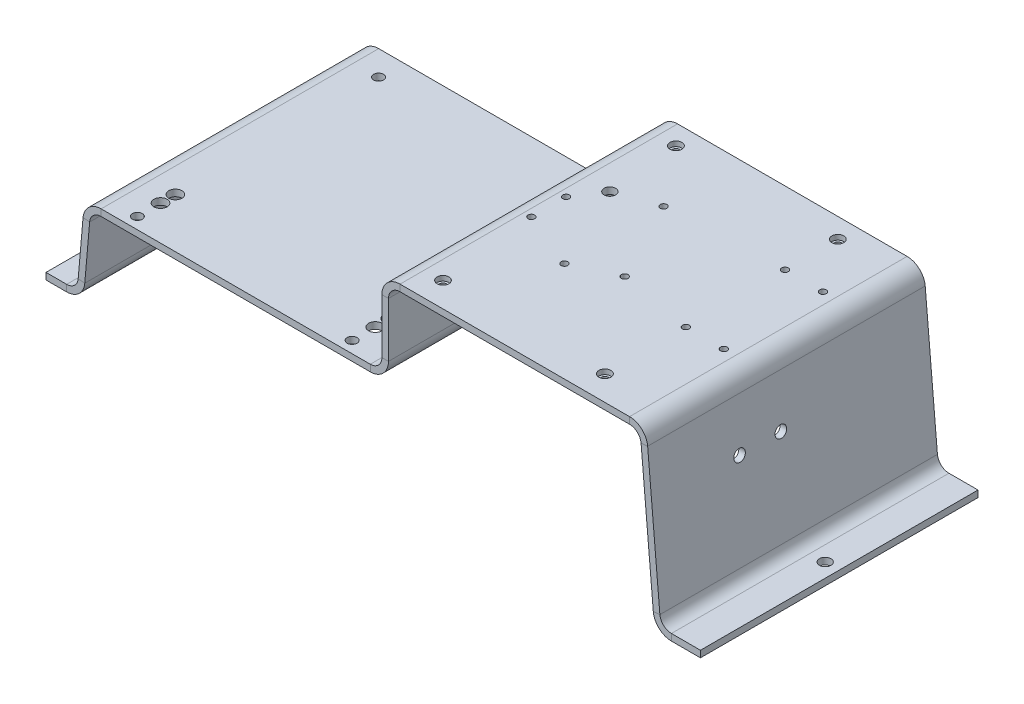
ISO-10303-21;
HEADER;
FILE_DESCRIPTION(('STEP AP214'),'2;1');
FILE_NAME('part.step','',(''),(''),'','','');
FILE_SCHEMA(('AUTOMOTIVE_DESIGN { 1 0 10303 214 1 1 1 1 }'));
ENDSEC;
DATA;
#1=APPLICATION_CONTEXT('core data for automotive mechanical design processes');
#2=APPLICATION_PROTOCOL_DEFINITION('international standard','automotive_design',2000,#1);
#3=PRODUCT_CONTEXT('',#1,'mechanical');
#4=PRODUCT('Part','Part','',(#3));
#5=PRODUCT_RELATED_PRODUCT_CATEGORY('part','',(#4));
#6=PRODUCT_DEFINITION_FORMATION('','',#4);
#7=PRODUCT_DEFINITION_CONTEXT('part definition',#1,'design');
#8=PRODUCT_DEFINITION('design','',#6,#7);
#9=PRODUCT_DEFINITION_SHAPE('','',#8);
#10=(LENGTH_UNIT() NAMED_UNIT(*) SI_UNIT(.MILLI.,.METRE.));
#11=(NAMED_UNIT(*) PLANE_ANGLE_UNIT() SI_UNIT($,.RADIAN.));
#12=(NAMED_UNIT(*) SI_UNIT($,.STERADIAN.) SOLID_ANGLE_UNIT());
#13=UNCERTAINTY_MEASURE_WITH_UNIT(LENGTH_MEASURE(1.E-05),#10,'distance_accuracy_value','');
#14=(GEOMETRIC_REPRESENTATION_CONTEXT(3) GLOBAL_UNCERTAINTY_ASSIGNED_CONTEXT((#13)) GLOBAL_UNIT_ASSIGNED_CONTEXT((#10,
#11,#12)) REPRESENTATION_CONTEXT('',''));
#15=CARTESIAN_POINT('',(0.,0.,0.));
#16=DIRECTION('',(0.,0.,1.));
#17=DIRECTION('',(1.,0.,0.));
#18=AXIS2_PLACEMENT_3D('',#15,#16,#17);
#19=CARTESIAN_POINT('',(19.4846114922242,6.38990980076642,168.));
#20=DIRECTION('',(0.,0.,1.));
#21=DIRECTION('',(1.,0.,0.));
#22=AXIS2_PLACEMENT_3D('',#19,#20,#21);
#23=PLANE('',#22);
#24=DIRECTION('',(0.996194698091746,-0.087155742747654,0.));
#25=VECTOR('',#24,1.);
#26=CARTESIAN_POINT('',(19.4846114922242,6.38990980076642,168.));
#27=LINE('',#26,#25);
#28=CARTESIAN_POINT('',(19.4846114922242,6.38990980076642,168.));
#29=VERTEX_POINT('',#28);
#30=CARTESIAN_POINT('',(23.4693902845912,6.0412868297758,168.));
#31=VERTEX_POINT('',#30);
#32=EDGE_CURVE('E11',#29,#31,#27,.T.);
#33=ORIENTED_EDGE('',*,*,#32,.F.);
#34=CARTESIAN_POINT('',(12.511248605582,7.,168.));
#35=DIRECTION('',(0.,0.,-1.));
#36=DIRECTION('',(-1.,0.,0.));
#37=AXIS2_PLACEMENT_3D('',#34,#35,#36);
#38=CIRCLE('',#37,7.);
#39=CARTESIAN_POINT('',(12.511248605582,0.,168.));
#40=VERTEX_POINT('',#39);
#41=EDGE_CURVE('E350',#40,#29,#38,.F.);
#42=ORIENTED_EDGE('',*,*,#41,.F.);
#43=DIRECTION('',(0.,1.,0.));
#44=VECTOR('',#43,1.);
#45=CARTESIAN_POINT('',(12.511248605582,-4.,168.));
#46=LINE('',#45,#44);
#47=CARTESIAN_POINT('',(12.511248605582,-4.,168.));
#48=VERTEX_POINT('',#47);
#49=EDGE_CURVE('E33',#48,#40,#46,.T.);
#50=ORIENTED_EDGE('',*,*,#49,.F.);
#51=CARTESIAN_POINT('',(12.511248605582,7.,168.));
#52=DIRECTION('',(0.,0.,1.));
#53=DIRECTION('',(1.,0.,0.));
#54=AXIS2_PLACEMENT_3D('',#51,#52,#53);
#55=CIRCLE('',#54,11.);
#56=EDGE_CURVE('E362',#48,#31,#55,.T.);
#57=ORIENTED_EDGE('',*,*,#56,.T.);
#58=EDGE_LOOP('',(#33,#42,#50,#57));
#59=FACE_BOUND('',#58,.T.);
#60=ADVANCED_FACE('F26',(#59),#23,.T.);
#61=CARTESIAN_POINT('',(12.511248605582,-4.,168.));
#62=DIRECTION('',(0.,0.,1.));
#63=DIRECTION('',(1.,0.,0.));
#64=AXIS2_PLACEMENT_3D('',#61,#62,#63);
#65=PLANE('',#64);
#66=DIRECTION('',(0.0871557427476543,0.996194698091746,0.));
#67=VECTOR('',#66,1.);
#68=CARTESIAN_POINT('',(18.925566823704,0.,168.));
#69=LINE('',#68,#67);
#70=CARTESIAN_POINT('',(22.4215012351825,39.9587131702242,168.));
#71=VERTEX_POINT('',#70);
#72=EDGE_CURVE('E347',#29,#71,#69,.T.);
#73=ORIENTED_EDGE('',*,*,#72,.F.);
#74=ORIENTED_EDGE('',*,*,#32,.T.);
#75=DIRECTION('',(0.0871557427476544,0.996194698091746,0.));
#76=VECTOR('',#75,1.);
#77=CARTESIAN_POINT('',(22.910345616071,-0.348622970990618,168.));
#78=LINE('',#77,#76);
#79=CARTESIAN_POINT('',(26.4062800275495,39.6100901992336,168.));
#80=VERTEX_POINT('',#79);
#81=EDGE_CURVE('E365',#31,#80,#78,.T.);
#82=ORIENTED_EDGE('',*,*,#81,.T.);
#83=DIRECTION('',(-0.996194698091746,0.0871557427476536,0.));
#84=VECTOR('',#83,1.);
#85=CARTESIAN_POINT('',(26.4062800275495,39.6100901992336,168.));
#86=LINE('',#85,#84);
#87=EDGE_CURVE('E501',#80,#71,#86,.T.);
#88=ORIENTED_EDGE('',*,*,#87,.T.);
#89=EDGE_LOOP('',(#73,#74,#82,#88));
#90=FACE_BOUND('',#89,.T.);
#91=ADVANCED_FACE('F543',(#90),#65,.T.);
#92=CARTESIAN_POINT('',(12.511248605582,0.,0.));
#93=DIRECTION('',(0.,0.,-1.));
#94=DIRECTION('',(-1.,0.,0.));
#95=AXIS2_PLACEMENT_3D('',#92,#93,#94);
#96=PLANE('',#95);
#97=DIRECTION('',(0.,-1.,0.));
#98=VECTOR('',#97,1.);
#99=CARTESIAN_POINT('',(12.511248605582,0.,0.));
#100=LINE('',#99,#98);
#101=CARTESIAN_POINT('',(12.511248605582,0.,0.));
#102=VERTEX_POINT('',#101);
#103=CARTESIAN_POINT('',(12.511248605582,-4.,0.));
#104=VERTEX_POINT('',#103);
#105=EDGE_CURVE('E507',#102,#104,#100,.T.);
#106=ORIENTED_EDGE('',*,*,#105,.F.);
#107=CARTESIAN_POINT('',(12.511248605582,7.,0.));
#108=DIRECTION('',(0.,0.,-1.));
#109=DIRECTION('',(-1.,0.,0.));
#110=AXIS2_PLACEMENT_3D('',#107,#108,#109);
#111=CIRCLE('',#110,7.);
#112=CARTESIAN_POINT('',(19.4846114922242,6.38990980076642,0.));
#113=VERTEX_POINT('',#112);
#114=EDGE_CURVE('E269',#102,#113,#111,.F.);
#115=ORIENTED_EDGE('',*,*,#114,.T.);
#116=DIRECTION('',(-0.996194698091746,0.087155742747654,0.));
#117=VECTOR('',#116,1.);
#118=CARTESIAN_POINT('',(23.4693902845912,6.0412868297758,0.));
#119=LINE('',#118,#117);
#120=CARTESIAN_POINT('',(23.4693902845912,6.0412868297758,0.));
#121=VERTEX_POINT('',#120);
#122=EDGE_CURVE('E505',#121,#113,#119,.T.);
#123=ORIENTED_EDGE('',*,*,#122,.F.);
#124=CARTESIAN_POINT('',(12.511248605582,7.,0.));
#125=DIRECTION('',(0.,0.,1.));
#126=DIRECTION('',(1.,0.,0.));
#127=AXIS2_PLACEMENT_3D('',#124,#125,#126);
#128=CIRCLE('',#127,11.);
#129=EDGE_CURVE('E281',#104,#121,#128,.T.);
#130=ORIENTED_EDGE('',*,*,#129,.F.);
#131=EDGE_LOOP('',(#106,#115,#123,#130));
#132=FACE_BOUND('',#131,.T.);
#133=ADVANCED_FACE('F551',(#132),#96,.T.);
#134=CARTESIAN_POINT('',(23.4693902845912,6.0412868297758,0.));
#135=DIRECTION('',(0.,0.,-1.));
#136=DIRECTION('',(-1.,0.,0.));
#137=AXIS2_PLACEMENT_3D('',#134,#135,#136);
#138=PLANE('',#137);
#139=DIRECTION('',(1.,0.,0.));
#140=VECTOR('',#139,1.);
#141=CARTESIAN_POINT('',(0.,0.,0.));
#142=LINE('',#141,#140);
#143=CARTESIAN_POINT('',(0.,0.,0.));
#144=VERTEX_POINT('',#143);
#145=EDGE_CURVE('E272',#144,#102,#142,.T.);
#146=ORIENTED_EDGE('',*,*,#145,.T.);
#147=ORIENTED_EDGE('',*,*,#105,.T.);
#148=DIRECTION('',(1.,0.,0.));
#149=VECTOR('',#148,1.);
#150=CARTESIAN_POINT('',(0.,-4.,0.));
#151=LINE('',#150,#149);
#152=CARTESIAN_POINT('',(0.,-4.,0.));
#153=VERTEX_POINT('',#152);
#154=EDGE_CURVE('E278',#153,#104,#151,.T.);
#155=ORIENTED_EDGE('',*,*,#154,.F.);
#156=DIRECTION('',(0.,1.,0.));
#157=VECTOR('',#156,1.);
#158=CARTESIAN_POINT('',(0.,-4.,0.));
#159=LINE('',#158,#157);
#160=EDGE_CURVE('E275',#153,#144,#159,.T.);
#161=ORIENTED_EDGE('',*,*,#160,.T.);
#162=EDGE_LOOP('',(#146,#147,#155,#161));
#163=FACE_BOUND('',#162,.T.);
#164=ADVANCED_FACE('F553',(#163),#138,.T.);
#165=CARTESIAN_POINT('',(33.3796429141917,50.,168.));
#166=DIRECTION('',(0.,0.,1.));
#167=DIRECTION('',(1.,0.,0.));
#168=AXIS2_PLACEMENT_3D('',#165,#166,#167);
#169=PLANE('',#168);
#170=DIRECTION('',(0.,-1.,0.));
#171=VECTOR('',#170,1.);
#172=CARTESIAN_POINT('',(33.3796429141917,50.,168.));
#173=LINE('',#172,#171);
#174=CARTESIAN_POINT('',(33.3796429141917,50.,168.));
#175=VERTEX_POINT('',#174);
#176=CARTESIAN_POINT('',(33.3796429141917,46.,168.));
#177=VERTEX_POINT('',#176);
#178=EDGE_CURVE('E503',#175,#177,#173,.T.);
#179=ORIENTED_EDGE('',*,*,#178,.F.);
#180=CARTESIAN_POINT('',(33.3796429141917,39.,168.));
#181=DIRECTION('',(0.,0.,1.));
#182=DIRECTION('',(1.,0.,0.));
#183=AXIS2_PLACEMENT_3D('',#180,#181,#182);
#184=CIRCLE('',#183,11.);
#185=EDGE_CURVE('E344',#71,#175,#184,.F.);
#186=ORIENTED_EDGE('',*,*,#185,.F.);
#187=ORIENTED_EDGE('',*,*,#87,.F.);
#188=CARTESIAN_POINT('',(33.3796429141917,39.,168.));
#189=DIRECTION('',(0.,0.,1.));
#190=DIRECTION('',(1.,0.,0.));
#191=AXIS2_PLACEMENT_3D('',#188,#189,#190);
#192=CIRCLE('',#191,7.);
#193=EDGE_CURVE('E368',#80,#177,#192,.F.);
#194=ORIENTED_EDGE('',*,*,#193,.T.);
#195=EDGE_LOOP('',(#179,#186,#187,#194));
#196=FACE_BOUND('',#195,.T.);
#197=ADVANCED_FACE('F555',(#196),#169,.T.);
#198=CARTESIAN_POINT('',(26.4062800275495,39.6100901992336,168.));
#199=DIRECTION('',(0.,0.,1.));
#200=DIRECTION('',(1.,0.,0.));
#201=AXIS2_PLACEMENT_3D('',#198,#199,#200);
#202=PLANE('',#201);
#203=DIRECTION('',(1.,0.,0.));
#204=VECTOR('',#203,1.);
#205=CARTESIAN_POINT('',(23.3,50.,168.));
#206=LINE('',#205,#204);
#207=CARTESIAN_POINT('',(196.3,50.,168.));
#208=VERTEX_POINT('',#207);
#209=EDGE_CURVE('E341',#175,#208,#206,.T.);
#210=ORIENTED_EDGE('',*,*,#209,.F.);
#211=ORIENTED_EDGE('',*,*,#178,.T.);
#212=DIRECTION('',(1.,0.,0.));
#213=VECTOR('',#212,1.);
#214=CARTESIAN_POINT('',(23.3,46.,168.));
#215=LINE('',#214,#213);
#216=CARTESIAN_POINT('',(196.3,46.,168.));
#217=VERTEX_POINT('',#216);
#218=EDGE_CURVE('E371',#177,#217,#215,.T.);
#219=ORIENTED_EDGE('',*,*,#218,.T.);
#220=DIRECTION('',(0.,1.,0.));
#221=VECTOR('',#220,1.);
#222=CARTESIAN_POINT('',(196.3,46.,168.));
#223=LINE('',#222,#221);
#224=EDGE_CURVE('E493',#217,#208,#223,.T.);
#225=ORIENTED_EDGE('',*,*,#224,.T.);
#226=EDGE_LOOP('',(#210,#211,#219,#225));
#227=FACE_BOUND('',#226,.T.);
#228=ADVANCED_FACE('F561',(#227),#202,.T.);
#229=CARTESIAN_POINT('',(22.4215012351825,39.9587131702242,0.));
#230=DIRECTION('',(0.,0.,-1.));
#231=DIRECTION('',(-1.,0.,0.));
#232=AXIS2_PLACEMENT_3D('',#229,#230,#231);
#233=PLANE('',#232);
#234=DIRECTION('',(0.996194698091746,-0.0871557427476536,0.));
#235=VECTOR('',#234,1.);
#236=CARTESIAN_POINT('',(22.4215012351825,39.9587131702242,0.));
#237=LINE('',#236,#235);
#238=CARTESIAN_POINT('',(22.4215012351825,39.9587131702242,0.));
#239=VERTEX_POINT('',#238);
#240=CARTESIAN_POINT('',(26.4062800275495,39.6100901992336,0.));
#241=VERTEX_POINT('',#240);
#242=EDGE_CURVE('E499',#239,#241,#237,.T.);
#243=ORIENTED_EDGE('',*,*,#242,.F.);
#244=CARTESIAN_POINT('',(33.3796429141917,39.,0.));
#245=DIRECTION('',(0.,0.,1.));
#246=DIRECTION('',(1.,0.,0.));
#247=AXIS2_PLACEMENT_3D('',#244,#245,#246);
#248=CIRCLE('',#247,11.);
#249=CARTESIAN_POINT('',(33.3796429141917,50.,0.));
#250=VERTEX_POINT('',#249);
#251=EDGE_CURVE('E263',#239,#250,#248,.F.);
#252=ORIENTED_EDGE('',*,*,#251,.T.);
#253=DIRECTION('',(0.,1.,0.));
#254=VECTOR('',#253,1.);
#255=CARTESIAN_POINT('',(33.3796429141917,46.,0.));
#256=LINE('',#255,#254);
#257=CARTESIAN_POINT('',(33.3796429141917,46.,0.));
#258=VERTEX_POINT('',#257);
#259=EDGE_CURVE('E497',#258,#250,#256,.T.);
#260=ORIENTED_EDGE('',*,*,#259,.F.);
#261=CARTESIAN_POINT('',(33.3796429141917,39.,0.));
#262=DIRECTION('',(0.,0.,1.));
#263=DIRECTION('',(1.,0.,0.));
#264=AXIS2_PLACEMENT_3D('',#261,#262,#263);
#265=CIRCLE('',#264,7.);
#266=EDGE_CURVE('E287',#241,#258,#265,.F.);
#267=ORIENTED_EDGE('',*,*,#266,.F.);
#268=EDGE_LOOP('',(#243,#252,#260,#267));
#269=FACE_BOUND('',#268,.T.);
#270=ADVANCED_FACE('F604',(#269),#233,.T.);
#271=CARTESIAN_POINT('',(33.3796429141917,46.,0.));
#272=DIRECTION('',(0.,0.,-1.));
#273=DIRECTION('',(-1.,0.,0.));
#274=AXIS2_PLACEMENT_3D('',#271,#272,#273);
#275=PLANE('',#274);
#276=DIRECTION('',(0.0871557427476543,0.996194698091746,0.));
#277=VECTOR('',#276,1.);
#278=CARTESIAN_POINT('',(18.925566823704,0.,0.));
#279=LINE('',#278,#277);
#280=EDGE_CURVE('E266',#113,#239,#279,.T.);
#281=ORIENTED_EDGE('',*,*,#280,.T.);
#282=ORIENTED_EDGE('',*,*,#242,.T.);
#283=DIRECTION('',(0.0871557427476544,0.996194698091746,0.));
#284=VECTOR('',#283,1.);
#285=CARTESIAN_POINT('',(22.910345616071,-0.348622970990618,0.));
#286=LINE('',#285,#284);
#287=EDGE_CURVE('E284',#121,#241,#286,.T.);
#288=ORIENTED_EDGE('',*,*,#287,.F.);
#289=ORIENTED_EDGE('',*,*,#122,.T.);
#290=EDGE_LOOP('',(#281,#282,#288,#289));
#291=FACE_BOUND('',#290,.T.);
#292=ADVANCED_FACE('F611',(#291),#275,.T.);
#293=CARTESIAN_POINT('',(203.3,57.,168.));
#294=DIRECTION('',(0.,0.,1.));
#295=DIRECTION('',(1.,0.,0.));
#296=AXIS2_PLACEMENT_3D('',#293,#294,#295);
#297=PLANE('',#296);
#298=DIRECTION('',(1.,0.,0.));
#299=VECTOR('',#298,1.);
#300=CARTESIAN_POINT('',(203.3,57.,168.));
#301=LINE('',#300,#299);
#302=CARTESIAN_POINT('',(203.3,57.,168.));
#303=VERTEX_POINT('',#302);
#304=CARTESIAN_POINT('',(207.3,57.,168.));
#305=VERTEX_POINT('',#304);
#306=EDGE_CURVE('E495',#303,#305,#301,.T.);
#307=ORIENTED_EDGE('',*,*,#306,.F.);
#308=CARTESIAN_POINT('',(196.3,57.,168.));
#309=DIRECTION('',(0.,0.,-1.));
#310=DIRECTION('',(-1.,0.,0.));
#311=AXIS2_PLACEMENT_3D('',#308,#309,#310);
#312=CIRCLE('',#311,7.);
#313=EDGE_CURVE('E338',#208,#303,#312,.F.);
#314=ORIENTED_EDGE('',*,*,#313,.F.);
#315=ORIENTED_EDGE('',*,*,#224,.F.);
#316=CARTESIAN_POINT('',(196.3,57.,168.));
#317=DIRECTION('',(0.,0.,1.));
#318=DIRECTION('',(1.,0.,0.));
#319=AXIS2_PLACEMENT_3D('',#316,#317,#318);
#320=CIRCLE('',#319,11.);
#321=EDGE_CURVE('E374',#217,#305,#320,.T.);
#322=ORIENTED_EDGE('',*,*,#321,.T.);
#323=EDGE_LOOP('',(#307,#314,#315,#322));
#324=FACE_BOUND('',#323,.T.);
#325=ADVANCED_FACE('F615',(#324),#297,.T.);
#326=CARTESIAN_POINT('',(196.3,46.,168.));
#327=DIRECTION('',(0.,0.,1.));
#328=DIRECTION('',(1.,0.,0.));
#329=AXIS2_PLACEMENT_3D('',#326,#327,#328);
#330=PLANE('',#329);
#331=DIRECTION('',(0.,1.,0.));
#332=VECTOR('',#331,1.);
#333=CARTESIAN_POINT('',(203.3,50.,168.));
#334=LINE('',#333,#332);
#335=CARTESIAN_POINT('',(203.3,90.,168.));
#336=VERTEX_POINT('',#335);
#337=EDGE_CURVE('E335',#303,#336,#334,.T.);
#338=ORIENTED_EDGE('',*,*,#337,.F.);
#339=ORIENTED_EDGE('',*,*,#306,.T.);
#340=DIRECTION('',(0.,1.,0.));
#341=VECTOR('',#340,1.);
#342=CARTESIAN_POINT('',(207.3,50.,168.));
#343=LINE('',#342,#341);
#344=CARTESIAN_POINT('',(207.3,90.,168.));
#345=VERTEX_POINT('',#344);
#346=EDGE_CURVE('E377',#305,#345,#343,.T.);
#347=ORIENTED_EDGE('',*,*,#346,.T.);
#348=DIRECTION('',(-1.,0.,0.));
#349=VECTOR('',#348,1.);
#350=CARTESIAN_POINT('',(207.3,90.,168.));
#351=LINE('',#350,#349);
#352=EDGE_CURVE('E485',#345,#336,#351,.T.);
#353=ORIENTED_EDGE('',*,*,#352,.T.);
#354=EDGE_LOOP('',(#338,#339,#347,#353));
#355=FACE_BOUND('',#354,.T.);
#356=ADVANCED_FACE('F620',(#355),#330,.T.);
#357=CARTESIAN_POINT('',(196.3,50.,0.));
#358=DIRECTION('',(0.,0.,-1.));
#359=DIRECTION('',(-1.,0.,0.));
#360=AXIS2_PLACEMENT_3D('',#357,#358,#359);
#361=PLANE('',#360);
#362=DIRECTION('',(0.,-1.,0.));
#363=VECTOR('',#362,1.);
#364=CARTESIAN_POINT('',(196.3,50.,0.));
#365=LINE('',#364,#363);
#366=CARTESIAN_POINT('',(196.3,50.,0.));
#367=VERTEX_POINT('',#366);
#368=CARTESIAN_POINT('',(196.3,46.,0.));
#369=VERTEX_POINT('',#368);
#370=EDGE_CURVE('E491',#367,#369,#365,.T.);
#371=ORIENTED_EDGE('',*,*,#370,.F.);
#372=CARTESIAN_POINT('',(196.3,57.,0.));
#373=DIRECTION('',(0.,0.,-1.));
#374=DIRECTION('',(-1.,0.,0.));
#375=AXIS2_PLACEMENT_3D('',#372,#373,#374);
#376=CIRCLE('',#375,7.);
#377=CARTESIAN_POINT('',(203.3,57.,0.));
#378=VERTEX_POINT('',#377);
#379=EDGE_CURVE('E257',#367,#378,#376,.F.);
#380=ORIENTED_EDGE('',*,*,#379,.T.);
#381=DIRECTION('',(-1.,0.,0.));
#382=VECTOR('',#381,1.);
#383=CARTESIAN_POINT('',(207.3,57.,0.));
#384=LINE('',#383,#382);
#385=CARTESIAN_POINT('',(207.3,57.,0.));
#386=VERTEX_POINT('',#385);
#387=EDGE_CURVE('E489',#386,#378,#384,.T.);
#388=ORIENTED_EDGE('',*,*,#387,.F.);
#389=CARTESIAN_POINT('',(196.3,57.,0.));
#390=DIRECTION('',(0.,0.,1.));
#391=DIRECTION('',(1.,0.,0.));
#392=AXIS2_PLACEMENT_3D('',#389,#390,#391);
#393=CIRCLE('',#392,11.);
#394=EDGE_CURVE('E293',#369,#386,#393,.T.);
#395=ORIENTED_EDGE('',*,*,#394,.F.);
#396=EDGE_LOOP('',(#371,#380,#388,#395));
#397=FACE_BOUND('',#396,.T.);
#398=ADVANCED_FACE('F624',(#397),#361,.T.);
#399=CARTESIAN_POINT('',(207.3,57.,0.));
#400=DIRECTION('',(0.,0.,-1.));
#401=DIRECTION('',(-1.,0.,0.));
#402=AXIS2_PLACEMENT_3D('',#399,#400,#401);
#403=PLANE('',#402);
#404=DIRECTION('',(1.,0.,0.));
#405=VECTOR('',#404,1.);
#406=CARTESIAN_POINT('',(23.3,50.,0.));
#407=LINE('',#406,#405);
#408=EDGE_CURVE('E260',#250,#367,#407,.T.);
#409=ORIENTED_EDGE('',*,*,#408,.T.);
#410=ORIENTED_EDGE('',*,*,#370,.T.);
#411=DIRECTION('',(1.,0.,0.));
#412=VECTOR('',#411,1.);
#413=CARTESIAN_POINT('',(23.3,46.,0.));
#414=LINE('',#413,#412);
#415=EDGE_CURVE('E290',#258,#369,#414,.T.);
#416=ORIENTED_EDGE('',*,*,#415,.F.);
#417=ORIENTED_EDGE('',*,*,#259,.T.);
#418=EDGE_LOOP('',(#409,#410,#416,#417));
#419=FACE_BOUND('',#418,.T.);
#420=ADVANCED_FACE('F630',(#419),#403,.T.);
#421=CARTESIAN_POINT('',(214.3,101.,168.));
#422=DIRECTION('',(0.,0.,1.));
#423=DIRECTION('',(1.,0.,0.));
#424=AXIS2_PLACEMENT_3D('',#421,#422,#423);
#425=PLANE('',#424);
#426=DIRECTION('',(0.,-1.,0.));
#427=VECTOR('',#426,1.);
#428=CARTESIAN_POINT('',(214.3,101.,168.));
#429=LINE('',#428,#427);
#430=CARTESIAN_POINT('',(214.3,101.,168.));
#431=VERTEX_POINT('',#430);
#432=CARTESIAN_POINT('',(214.3,97.,168.));
#433=VERTEX_POINT('',#432);
#434=EDGE_CURVE('E487',#431,#433,#429,.T.);
#435=ORIENTED_EDGE('',*,*,#434,.F.);
#436=CARTESIAN_POINT('',(214.3,90.,168.));
#437=DIRECTION('',(0.,0.,1.));
#438=DIRECTION('',(1.,0.,0.));
#439=AXIS2_PLACEMENT_3D('',#436,#437,#438);
#440=CIRCLE('',#439,11.);
#441=EDGE_CURVE('E332',#336,#431,#440,.F.);
#442=ORIENTED_EDGE('',*,*,#441,.F.);
#443=ORIENTED_EDGE('',*,*,#352,.F.);
#444=CARTESIAN_POINT('',(214.3,90.,168.));
#445=DIRECTION('',(0.,0.,1.));
#446=DIRECTION('',(1.,0.,0.));
#447=AXIS2_PLACEMENT_3D('',#444,#445,#446);
#448=CIRCLE('',#447,7.);
#449=EDGE_CURVE('E380',#345,#433,#448,.F.);
#450=ORIENTED_EDGE('',*,*,#449,.T.);
#451=EDGE_LOOP('',(#435,#442,#443,#450));
#452=FACE_BOUND('',#451,.T.);
#453=ADVANCED_FACE('F634',(#452),#425,.T.);
#454=CARTESIAN_POINT('',(207.3,90.,168.));
#455=DIRECTION('',(0.,0.,1.));
#456=DIRECTION('',(1.,0.,0.));
#457=AXIS2_PLACEMENT_3D('',#454,#455,#456);
#458=PLANE('',#457);
#459=DIRECTION('',(1.,0.,0.));
#460=VECTOR('',#459,1.);
#461=CARTESIAN_POINT('',(203.3,101.,168.));
#462=LINE('',#461,#460);
#463=CARTESIAN_POINT('',(353.220357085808,101.,168.));
#464=VERTEX_POINT('',#463);
#465=EDGE_CURVE('E329',#431,#464,#462,.T.);
#466=ORIENTED_EDGE('',*,*,#465,.F.);
#467=ORIENTED_EDGE('',*,*,#434,.T.);
#468=DIRECTION('',(1.,0.,0.));
#469=VECTOR('',#468,1.);
#470=CARTESIAN_POINT('',(203.3,97.,168.));
#471=LINE('',#470,#469);
#472=CARTESIAN_POINT('',(353.220357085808,97.,168.));
#473=VERTEX_POINT('',#472);
#474=EDGE_CURVE('E383',#433,#473,#471,.T.);
#475=ORIENTED_EDGE('',*,*,#474,.T.);
#476=DIRECTION('',(0.,1.,0.));
#477=VECTOR('',#476,1.);
#478=CARTESIAN_POINT('',(353.220357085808,97.,168.));
#479=LINE('',#478,#477);
#480=EDGE_CURVE('E477',#473,#464,#479,.T.);
#481=ORIENTED_EDGE('',*,*,#480,.T.);
#482=EDGE_LOOP('',(#466,#467,#475,#481));
#483=FACE_BOUND('',#482,.T.);
#484=ADVANCED_FACE('F640',(#483),#458,.T.);
#485=CARTESIAN_POINT('',(203.3,90.,0.));
#486=DIRECTION('',(0.,0.,-1.));
#487=DIRECTION('',(-1.,0.,0.));
#488=AXIS2_PLACEMENT_3D('',#485,#486,#487);
#489=PLANE('',#488);
#490=DIRECTION('',(1.,0.,0.));
#491=VECTOR('',#490,1.);
#492=CARTESIAN_POINT('',(203.3,90.,0.));
#493=LINE('',#492,#491);
#494=CARTESIAN_POINT('',(203.3,90.,0.));
#495=VERTEX_POINT('',#494);
#496=CARTESIAN_POINT('',(207.3,90.,0.));
#497=VERTEX_POINT('',#496);
#498=EDGE_CURVE('E483',#495,#497,#493,.T.);
#499=ORIENTED_EDGE('',*,*,#498,.F.);
#500=CARTESIAN_POINT('',(214.3,90.,0.));
#501=DIRECTION('',(0.,0.,1.));
#502=DIRECTION('',(1.,0.,0.));
#503=AXIS2_PLACEMENT_3D('',#500,#501,#502);
#504=CIRCLE('',#503,11.);
#505=CARTESIAN_POINT('',(214.3,101.,0.));
#506=VERTEX_POINT('',#505);
#507=EDGE_CURVE('E251',#495,#506,#504,.F.);
#508=ORIENTED_EDGE('',*,*,#507,.T.);
#509=DIRECTION('',(0.,1.,0.));
#510=VECTOR('',#509,1.);
#511=CARTESIAN_POINT('',(214.3,97.,0.));
#512=LINE('',#511,#510);
#513=CARTESIAN_POINT('',(214.3,97.,0.));
#514=VERTEX_POINT('',#513);
#515=EDGE_CURVE('E481',#514,#506,#512,.T.);
#516=ORIENTED_EDGE('',*,*,#515,.F.);
#517=CARTESIAN_POINT('',(214.3,90.,0.));
#518=DIRECTION('',(0.,0.,1.));
#519=DIRECTION('',(1.,0.,0.));
#520=AXIS2_PLACEMENT_3D('',#517,#518,#519);
#521=CIRCLE('',#520,7.);
#522=EDGE_CURVE('E299',#497,#514,#521,.F.);
#523=ORIENTED_EDGE('',*,*,#522,.F.);
#524=EDGE_LOOP('',(#499,#508,#516,#523));
#525=FACE_BOUND('',#524,.T.);
#526=ADVANCED_FACE('F644',(#525),#489,.T.);
#527=CARTESIAN_POINT('',(214.3,97.,0.));
#528=DIRECTION('',(0.,0.,-1.));
#529=DIRECTION('',(-1.,0.,0.));
#530=AXIS2_PLACEMENT_3D('',#527,#528,#529);
#531=PLANE('',#530);
#532=DIRECTION('',(0.,1.,0.));
#533=VECTOR('',#532,1.);
#534=CARTESIAN_POINT('',(203.3,50.,0.));
#535=LINE('',#534,#533);
#536=EDGE_CURVE('E254',#378,#495,#535,.T.);
#537=ORIENTED_EDGE('',*,*,#536,.T.);
#538=ORIENTED_EDGE('',*,*,#498,.T.);
#539=DIRECTION('',(0.,1.,0.));
#540=VECTOR('',#539,1.);
#541=CARTESIAN_POINT('',(207.3,50.,0.));
#542=LINE('',#541,#540);
#543=EDGE_CURVE('E296',#386,#497,#542,.T.);
#544=ORIENTED_EDGE('',*,*,#543,.F.);
#545=ORIENTED_EDGE('',*,*,#387,.T.);
#546=EDGE_LOOP('',(#537,#538,#544,#545));
#547=FACE_BOUND('',#546,.T.);
#548=ADVANCED_FACE('F650',(#547),#531,.T.);
#549=CARTESIAN_POINT('',(364.178498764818,90.9587131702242,168.));
#550=DIRECTION('',(0.,0.,1.));
#551=DIRECTION('',(1.,0.,0.));
#552=AXIS2_PLACEMENT_3D('',#549,#550,#551);
#553=PLANE('',#552);
#554=DIRECTION('',(-0.996194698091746,-0.0871557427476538,0.));
#555=VECTOR('',#554,1.);
#556=CARTESIAN_POINT('',(364.178498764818,90.9587131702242,168.));
#557=LINE('',#556,#555);
#558=CARTESIAN_POINT('',(364.178498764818,90.9587131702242,168.));
#559=VERTEX_POINT('',#558);
#560=CARTESIAN_POINT('',(360.193719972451,90.6100901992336,168.));
#561=VERTEX_POINT('',#560);
#562=EDGE_CURVE('E479',#559,#561,#557,.T.);
#563=ORIENTED_EDGE('',*,*,#562,.F.);
#564=CARTESIAN_POINT('',(353.220357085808,90.,168.));
#565=DIRECTION('',(0.,0.,1.));
#566=DIRECTION('',(1.,0.,0.));
#567=AXIS2_PLACEMENT_3D('',#564,#565,#566);
#568=CIRCLE('',#567,11.);
#569=EDGE_CURVE('E326',#464,#559,#568,.F.);
#570=ORIENTED_EDGE('',*,*,#569,.F.);
#571=ORIENTED_EDGE('',*,*,#480,.F.);
#572=CARTESIAN_POINT('',(353.220357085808,90.,168.));
#573=DIRECTION('',(0.,0.,1.));
#574=DIRECTION('',(1.,0.,0.));
#575=AXIS2_PLACEMENT_3D('',#572,#573,#574);
#576=CIRCLE('',#575,7.);
#577=EDGE_CURVE('E386',#473,#561,#576,.F.);
#578=ORIENTED_EDGE('',*,*,#577,.T.);
#579=EDGE_LOOP('',(#563,#570,#571,#578));
#580=FACE_BOUND('',#579,.T.);
#581=ADVANCED_FACE('F654',(#580),#553,.T.);
#582=CARTESIAN_POINT('',(353.220357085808,97.,168.));
#583=DIRECTION('',(0.,0.,1.));
#584=DIRECTION('',(1.,0.,0.));
#585=AXIS2_PLACEMENT_3D('',#582,#583,#584);
#586=PLANE('',#585);
#587=DIRECTION('',(0.0871557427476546,-0.996194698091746,0.));
#588=VECTOR('',#587,1.);
#589=CARTESIAN_POINT('',(363.3,101.,168.));
#590=LINE('',#589,#588);
#591=CARTESIAN_POINT('',(371.577310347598,6.38990980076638,168.));
#592=VERTEX_POINT('',#591);
#593=EDGE_CURVE('E323',#559,#592,#590,.T.);
#594=ORIENTED_EDGE('',*,*,#593,.F.);
#595=ORIENTED_EDGE('',*,*,#562,.T.);
#596=DIRECTION('',(0.0871557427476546,-0.996194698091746,0.));
#597=VECTOR('',#596,1.);
#598=CARTESIAN_POINT('',(359.315221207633,100.651377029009,168.));
#599=LINE('',#598,#597);
#600=CARTESIAN_POINT('',(367.592531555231,6.04128682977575,168.));
#601=VERTEX_POINT('',#600);
#602=EDGE_CURVE('E389',#561,#601,#599,.T.);
#603=ORIENTED_EDGE('',*,*,#602,.T.);
#604=DIRECTION('',(0.996194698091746,0.0871557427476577,0.));
#605=VECTOR('',#604,1.);
#606=CARTESIAN_POINT('',(367.592531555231,6.04128682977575,168.));
#607=LINE('',#606,#605);
#608=EDGE_CURVE('E47',#601,#592,#607,.T.);
#609=ORIENTED_EDGE('',*,*,#608,.T.);
#610=EDGE_LOOP('',(#594,#595,#603,#609));
#611=FACE_BOUND('',#610,.T.);
#612=ADVANCED_FACE('F660',(#611),#586,.T.);
#613=CARTESIAN_POINT('',(353.220357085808,101.,0.));
#614=DIRECTION('',(0.,0.,-1.));
#615=DIRECTION('',(-1.,0.,0.));
#616=AXIS2_PLACEMENT_3D('',#613,#614,#615);
#617=PLANE('',#616);
#618=DIRECTION('',(0.,-1.,0.));
#619=VECTOR('',#618,1.);
#620=CARTESIAN_POINT('',(353.220357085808,101.,0.));
#621=LINE('',#620,#619);
#622=CARTESIAN_POINT('',(353.220357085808,101.,0.));
#623=VERTEX_POINT('',#622);
#624=CARTESIAN_POINT('',(353.220357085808,97.,0.));
#625=VERTEX_POINT('',#624);
#626=EDGE_CURVE('E475',#623,#625,#621,.T.);
#627=ORIENTED_EDGE('',*,*,#626,.F.);
#628=CARTESIAN_POINT('',(353.220357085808,90.,0.));
#629=DIRECTION('',(0.,0.,1.));
#630=DIRECTION('',(1.,0.,0.));
#631=AXIS2_PLACEMENT_3D('',#628,#629,#630);
#632=CIRCLE('',#631,11.);
#633=CARTESIAN_POINT('',(364.178498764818,90.9587131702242,0.));
#634=VERTEX_POINT('',#633);
#635=EDGE_CURVE('E245',#623,#634,#632,.F.);
#636=ORIENTED_EDGE('',*,*,#635,.T.);
#637=DIRECTION('',(0.996194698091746,0.0871557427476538,0.));
#638=VECTOR('',#637,1.);
#639=CARTESIAN_POINT('',(360.193719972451,90.6100901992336,0.));
#640=LINE('',#639,#638);
#641=CARTESIAN_POINT('',(360.193719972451,90.6100901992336,0.));
#642=VERTEX_POINT('',#641);
#643=EDGE_CURVE('E473',#642,#634,#640,.T.);
#644=ORIENTED_EDGE('',*,*,#643,.F.);
#645=CARTESIAN_POINT('',(353.220357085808,90.,0.));
#646=DIRECTION('',(0.,0.,1.));
#647=DIRECTION('',(1.,0.,0.));
#648=AXIS2_PLACEMENT_3D('',#645,#646,#647);
#649=CIRCLE('',#648,7.);
#650=EDGE_CURVE('E305',#625,#642,#649,.F.);
#651=ORIENTED_EDGE('',*,*,#650,.F.);
#652=EDGE_LOOP('',(#627,#636,#644,#651));
#653=FACE_BOUND('',#652,.T.);
#654=ADVANCED_FACE('F664',(#653),#617,.T.);
#655=CARTESIAN_POINT('',(360.193719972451,90.6100901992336,0.));
#656=DIRECTION('',(0.,0.,-1.));
#657=DIRECTION('',(-1.,0.,0.));
#658=AXIS2_PLACEMENT_3D('',#655,#656,#657);
#659=PLANE('',#658);
#660=DIRECTION('',(1.,0.,0.));
#661=VECTOR('',#660,1.);
#662=CARTESIAN_POINT('',(203.3,101.,0.));
#663=LINE('',#662,#661);
#664=EDGE_CURVE('E248',#506,#623,#663,.T.);
#665=ORIENTED_EDGE('',*,*,#664,.T.);
#666=ORIENTED_EDGE('',*,*,#626,.T.);
#667=DIRECTION('',(1.,0.,0.));
#668=VECTOR('',#667,1.);
#669=CARTESIAN_POINT('',(203.3,97.,0.));
#670=LINE('',#669,#668);
#671=EDGE_CURVE('E302',#514,#625,#670,.T.);
#672=ORIENTED_EDGE('',*,*,#671,.F.);
#673=ORIENTED_EDGE('',*,*,#515,.T.);
#674=EDGE_LOOP('',(#665,#666,#672,#673));
#675=FACE_BOUND('',#674,.T.);
#676=ADVANCED_FACE('F670',(#675),#659,.T.);
#677=CARTESIAN_POINT('',(378.55067323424,0.,168.));
#678=DIRECTION('',(0.,0.,1.));
#679=DIRECTION('',(1.,0.,0.));
#680=AXIS2_PLACEMENT_3D('',#677,#678,#679);
#681=PLANE('',#680);
#682=DIRECTION('',(0.,-1.,0.));
#683=VECTOR('',#682,1.);
#684=CARTESIAN_POINT('',(378.55067323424,0.,168.));
#685=LINE('',#684,#683);
#686=CARTESIAN_POINT('',(378.55067323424,0.,168.));
#687=VERTEX_POINT('',#686);
#688=CARTESIAN_POINT('',(378.55067323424,-4.,168.));
#689=VERTEX_POINT('',#688);
#690=EDGE_CURVE('E40',#687,#689,#685,.T.);
#691=ORIENTED_EDGE('',*,*,#690,.F.);
#692=CARTESIAN_POINT('',(378.55067323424,7.,168.));
#693=DIRECTION('',(0.,0.,-1.));
#694=DIRECTION('',(-1.,0.,0.));
#695=AXIS2_PLACEMENT_3D('',#692,#693,#694);
#696=CIRCLE('',#695,7.);
#697=EDGE_CURVE('E320',#592,#687,#696,.F.);
#698=ORIENTED_EDGE('',*,*,#697,.F.);
#699=ORIENTED_EDGE('',*,*,#608,.F.);
#700=CARTESIAN_POINT('',(378.55067323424,7.,168.));
#701=DIRECTION('',(0.,0.,1.));
#702=DIRECTION('',(1.,0.,0.));
#703=AXIS2_PLACEMENT_3D('',#700,#701,#702);
#704=CIRCLE('',#703,11.);
#705=EDGE_CURVE('E391',#601,#689,#704,.T.);
#706=ORIENTED_EDGE('',*,*,#705,.T.);
#707=EDGE_LOOP('',(#691,#698,#699,#706));
#708=FACE_BOUND('',#707,.T.);
#709=ADVANCED_FACE('F674',(#708),#681,.T.);
#710=CARTESIAN_POINT('',(367.592531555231,6.04128682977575,168.));
#711=DIRECTION('',(0.,0.,1.));
#712=DIRECTION('',(1.,0.,0.));
#713=AXIS2_PLACEMENT_3D('',#710,#711,#712);
#714=PLANE('',#713);
#715=DIRECTION('',(1.,0.,0.));
#716=VECTOR('',#715,1.);
#717=CARTESIAN_POINT('',(372.136355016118,0.,168.));
#718=LINE('',#717,#716);
#719=CARTESIAN_POINT('',(396.136355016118,0.,168.));
#720=VERTEX_POINT('',#719);
#721=EDGE_CURVE('E317',#687,#720,#718,.T.);
#722=ORIENTED_EDGE('',*,*,#721,.F.);
#723=ORIENTED_EDGE('',*,*,#690,.T.);
#724=DIRECTION('',(1.,0.,0.));
#725=VECTOR('',#724,1.);
#726=CARTESIAN_POINT('',(372.136355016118,-4.,168.));
#727=LINE('',#726,#725);
#728=CARTESIAN_POINT('',(396.136355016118,-4.,168.));
#729=VERTEX_POINT('',#728);
#730=EDGE_CURVE('E314',#689,#729,#727,.T.);
#731=ORIENTED_EDGE('',*,*,#730,.T.);
#732=DIRECTION('',(0.,-1.,0.));
#733=VECTOR('',#732,1.);
#734=CARTESIAN_POINT('',(396.136355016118,0.,168.));
#735=LINE('',#734,#733);
#736=EDGE_CURVE('E217',#720,#729,#735,.T.);
#737=ORIENTED_EDGE('',*,*,#736,.F.);
#738=EDGE_LOOP('',(#722,#723,#731,#737));
#739=FACE_BOUND('',#738,.T.);
#740=ADVANCED_FACE('F680',(#739),#714,.T.);
#741=CARTESIAN_POINT('',(371.577310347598,6.38990980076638,0.));
#742=DIRECTION('',(0.,0.,-1.));
#743=DIRECTION('',(-1.,0.,0.));
#744=AXIS2_PLACEMENT_3D('',#741,#742,#743);
#745=PLANE('',#744);
#746=DIRECTION('',(-0.996194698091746,-0.0871557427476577,0.));
#747=VECTOR('',#746,1.);
#748=CARTESIAN_POINT('',(371.577310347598,6.38990980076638,0.));
#749=LINE('',#748,#747);
#750=CARTESIAN_POINT('',(371.577310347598,6.38990980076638,0.));
#751=VERTEX_POINT('',#750);
#752=CARTESIAN_POINT('',(367.592531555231,6.04128682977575,0.));
#753=VERTEX_POINT('',#752);
#754=EDGE_CURVE('E469',#751,#753,#749,.T.);
#755=ORIENTED_EDGE('',*,*,#754,.F.);
#756=CARTESIAN_POINT('',(378.55067323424,7.,0.));
#757=DIRECTION('',(0.,0.,-1.));
#758=DIRECTION('',(-1.,0.,0.));
#759=AXIS2_PLACEMENT_3D('',#756,#757,#758);
#760=CIRCLE('',#759,7.);
#761=CARTESIAN_POINT('',(378.55067323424,0.,0.));
#762=VERTEX_POINT('',#761);
#763=EDGE_CURVE('E236',#751,#762,#760,.F.);
#764=ORIENTED_EDGE('',*,*,#763,.T.);
#765=DIRECTION('',(0.,1.,0.));
#766=VECTOR('',#765,1.);
#767=CARTESIAN_POINT('',(378.55067323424,-4.,0.));
#768=LINE('',#767,#766);
#769=CARTESIAN_POINT('',(378.55067323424,-4.,0.));
#770=VERTEX_POINT('',#769);
#771=EDGE_CURVE('E220',#770,#762,#768,.T.);
#772=ORIENTED_EDGE('',*,*,#771,.F.);
#773=CARTESIAN_POINT('',(378.55067323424,7.,0.));
#774=DIRECTION('',(0.,0.,1.));
#775=DIRECTION('',(1.,0.,0.));
#776=AXIS2_PLACEMENT_3D('',#773,#774,#775);
#777=CIRCLE('',#776,11.);
#778=EDGE_CURVE('E311',#753,#770,#777,.T.);
#779=ORIENTED_EDGE('',*,*,#778,.F.);
#780=EDGE_LOOP('',(#755,#764,#772,#779));
#781=FACE_BOUND('',#780,.T.);
#782=ADVANCED_FACE('F684',(#781),#745,.T.);
#783=CARTESIAN_POINT('',(378.55067323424,-4.,0.));
#784=DIRECTION('',(0.,0.,-1.));
#785=DIRECTION('',(-1.,0.,0.));
#786=AXIS2_PLACEMENT_3D('',#783,#784,#785);
#787=PLANE('',#786);
#788=DIRECTION('',(0.0871557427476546,-0.996194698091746,0.));
#789=VECTOR('',#788,1.);
#790=CARTESIAN_POINT('',(363.3,101.,0.));
#791=LINE('',#790,#789);
#792=EDGE_CURVE('E242',#634,#751,#791,.T.);
#793=ORIENTED_EDGE('',*,*,#792,.T.);
#794=ORIENTED_EDGE('',*,*,#754,.T.);
#795=DIRECTION('',(0.0871557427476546,-0.996194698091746,0.));
#796=VECTOR('',#795,1.);
#797=CARTESIAN_POINT('',(359.315221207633,100.651377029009,0.));
#798=LINE('',#797,#796);
#799=EDGE_CURVE('E308',#642,#753,#798,.T.);
#800=ORIENTED_EDGE('',*,*,#799,.F.);
#801=ORIENTED_EDGE('',*,*,#643,.T.);
#802=EDGE_LOOP('',(#793,#794,#800,#801));
#803=FACE_BOUND('',#802,.T.);
#804=ADVANCED_FACE('F689',(#803),#787,.T.);
#805=CARTESIAN_POINT('',(372.136355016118,-4.,168.));
#806=DIRECTION('',(0.,1.,0.));
#807=DIRECTION('',(0.,0.,1.));
#808=AXIS2_PLACEMENT_3D('',#805,#806,#807);
#809=PLANE('',#808);
#810=CARTESIAN_POINT('',(387.636355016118,-4.,84.));
#811=DIRECTION('',(0.,1.,0.));
#812=DIRECTION('',(0.,0.,1.));
#813=AXIS2_PLACEMENT_3D('',#810,#811,#812);
#814=CIRCLE('',#813,3.5);
#815=CARTESIAN_POINT('',(387.636355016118,-4.,87.5));
#816=VERTEX_POINT('',#815);
#817=EDGE_CURVE('E1473',#816,#816,#814,.T.);
#818=ORIENTED_EDGE('',*,*,#817,.T.);
#819=EDGE_LOOP('',(#818));
#820=FACE_BOUND('',#819,.T.);
#821=DIRECTION('',(1.,0.,0.));
#822=VECTOR('',#821,1.);
#823=CARTESIAN_POINT('',(372.136355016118,-4.,0.));
#824=LINE('',#823,#822);
#825=CARTESIAN_POINT('',(396.136355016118,-4.,0.));
#826=VERTEX_POINT('',#825);
#827=EDGE_CURVE('E225',#770,#826,#824,.T.);
#828=ORIENTED_EDGE('',*,*,#827,.T.);
#829=DIRECTION('',(0.,0.,-1.));
#830=VECTOR('',#829,1.);
#831=CARTESIAN_POINT('',(396.136355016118,-4.,168.));
#832=LINE('',#831,#830);
#833=EDGE_CURVE('E210',#729,#826,#832,.T.);
#834=ORIENTED_EDGE('',*,*,#833,.F.);
#835=ORIENTED_EDGE('',*,*,#730,.F.);
#836=DIRECTION('',(0.,0.,-1.));
#837=VECTOR('',#836,1.);
#838=CARTESIAN_POINT('',(378.55067323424,-4.,168.));
#839=LINE('',#838,#837);
#840=EDGE_CURVE('E228',#689,#770,#839,.T.);
#841=ORIENTED_EDGE('',*,*,#840,.T.);
#842=EDGE_LOOP('',(#828,#834,#835,#841));
#843=FACE_BOUND('',#842,.T.);
#844=ADVANCED_FACE('F226',(#820,#843),#809,.F.);
#845=CARTESIAN_POINT('',(396.136355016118,0.,168.));
#846=DIRECTION('',(1.,0.,0.));
#847=DIRECTION('',(0.,0.,-1.));
#848=AXIS2_PLACEMENT_3D('',#845,#846,#847);
#849=PLANE('',#848);
#850=DIRECTION('',(0.,-1.,0.));
#851=VECTOR('',#850,1.);
#852=CARTESIAN_POINT('',(396.136355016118,0.,0.));
#853=LINE('',#852,#851);
#854=CARTESIAN_POINT('',(396.136355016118,0.,0.));
#855=VERTEX_POINT('',#854);
#856=EDGE_CURVE('E214',#855,#826,#853,.T.);
#857=ORIENTED_EDGE('',*,*,#856,.F.);
#858=DIRECTION('',(0.,0.,-1.));
#859=VECTOR('',#858,1.);
#860=CARTESIAN_POINT('',(396.136355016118,0.,168.));
#861=LINE('',#860,#859);
#862=EDGE_CURVE('E221',#720,#855,#861,.T.);
#863=ORIENTED_EDGE('',*,*,#862,.F.);
#864=ORIENTED_EDGE('',*,*,#736,.T.);
#865=ORIENTED_EDGE('',*,*,#833,.T.);
#866=EDGE_LOOP('',(#857,#863,#864,#865));
#867=FACE_BOUND('',#866,.T.);
#868=ADVANCED_FACE('F212',(#867),#849,.T.);
#869=CARTESIAN_POINT('',(372.136355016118,0.,168.));
#870=DIRECTION('',(0.,1.,0.));
#871=DIRECTION('',(0.,0.,1.));
#872=AXIS2_PLACEMENT_3D('',#869,#870,#871);
#873=PLANE('',#872);
#874=CARTESIAN_POINT('',(387.636355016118,0.,84.));
#875=DIRECTION('',(0.,1.,0.));
#876=DIRECTION('',(0.,0.,1.));
#877=AXIS2_PLACEMENT_3D('',#874,#875,#876);
#878=CIRCLE('',#877,3.5);
#879=CARTESIAN_POINT('',(387.636355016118,0.,87.5));
#880=VERTEX_POINT('',#879);
#881=EDGE_CURVE('E1476',#880,#880,#878,.T.);
#882=ORIENTED_EDGE('',*,*,#881,.F.);
#883=EDGE_LOOP('',(#882));
#884=FACE_BOUND('',#883,.T.);
#885=DIRECTION('',(1.,0.,0.));
#886=VECTOR('',#885,1.);
#887=CARTESIAN_POINT('',(372.136355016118,0.,0.));
#888=LINE('',#887,#886);
#889=EDGE_CURVE('E234',#762,#855,#888,.T.);
#890=ORIENTED_EDGE('',*,*,#889,.F.);
#891=DIRECTION('',(0.,0.,-1.));
#892=VECTOR('',#891,1.);
#893=CARTESIAN_POINT('',(378.55067323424,0.,168.));
#894=LINE('',#893,#892);
#895=EDGE_CURVE('E464',#687,#762,#894,.T.);
#896=ORIENTED_EDGE('',*,*,#895,.F.);
#897=ORIENTED_EDGE('',*,*,#721,.T.);
#898=ORIENTED_EDGE('',*,*,#862,.T.);
#899=EDGE_LOOP('',(#890,#896,#897,#898));
#900=FACE_BOUND('',#899,.T.);
#901=ADVANCED_FACE('F709',(#884,#900),#873,.T.);
#902=CARTESIAN_POINT('',(378.55067323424,7.,168.));
#903=DIRECTION('',(0.,0.,-1.));
#904=DIRECTION('',(-1.,0.,0.));
#905=AXIS2_PLACEMENT_3D('',#902,#903,#904);
#906=CYLINDRICAL_SURFACE('',#905,7.);
#907=ORIENTED_EDGE('',*,*,#763,.F.);
#908=DIRECTION('',(0.,0.,-1.));
#909=VECTOR('',#908,1.);
#910=CARTESIAN_POINT('',(371.577310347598,6.38990980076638,168.));
#911=LINE('',#910,#909);
#912=EDGE_CURVE('E461',#592,#751,#911,.T.);
#913=ORIENTED_EDGE('',*,*,#912,.F.);
#914=ORIENTED_EDGE('',*,*,#697,.T.);
#915=ORIENTED_EDGE('',*,*,#895,.T.);
#916=EDGE_LOOP('',(#907,#913,#914,#915));
#917=FACE_BOUND('',#916,.T.);
#918=ADVANCED_FACE('F717',(#917),#906,.F.);
#919=CARTESIAN_POINT('',(363.3,101.,168.));
#920=DIRECTION('',(0.996194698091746,0.0871557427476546,0.));
#921=DIRECTION('',(-0.0871557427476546,0.996194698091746,0.));
#922=AXIS2_PLACEMENT_3D('',#919,#920,#921);
#923=PLANE('',#922);
#924=CARTESIAN_POINT('',(366.799546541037,61.,115.));
#925=DIRECTION('',(0.996194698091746,0.0871557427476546,0.));
#926=DIRECTION('',(-0.0871557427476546,0.996194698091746,0.));
#927=AXIS2_PLACEMENT_3D('',#924,#925,#926);
#928=CIRCLE('',#927,3.5);
#929=CARTESIAN_POINT('',(366.49450144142,64.4866814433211,115.));
#930=VERTEX_POINT('',#929);
#931=EDGE_CURVE('E1320',#930,#930,#928,.T.);
#932=ORIENTED_EDGE('',*,*,#931,.F.);
#933=EDGE_LOOP('',(#932));
#934=FACE_BOUND('',#933,.T.);
#935=CARTESIAN_POINT('',(366.799546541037,61.,90.));
#936=DIRECTION('',(0.996194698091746,0.0871557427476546,0.));
#937=DIRECTION('',(-0.0871557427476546,0.996194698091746,0.));
#938=AXIS2_PLACEMENT_3D('',#935,#936,#937);
#939=CIRCLE('',#938,3.5);
#940=CARTESIAN_POINT('',(366.49450144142,64.4866814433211,90.));
#941=VERTEX_POINT('',#940);
#942=EDGE_CURVE('E1326',#941,#941,#939,.T.);
#943=ORIENTED_EDGE('',*,*,#942,.F.);
#944=EDGE_LOOP('',(#943));
#945=FACE_BOUND('',#944,.T.);
#946=ORIENTED_EDGE('',*,*,#792,.F.);
#947=DIRECTION('',(0.,0.,-1.));
#948=VECTOR('',#947,1.);
#949=CARTESIAN_POINT('',(364.178498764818,90.9587131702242,168.));
#950=LINE('',#949,#948);
#951=EDGE_CURVE('E458',#559,#634,#950,.T.);
#952=ORIENTED_EDGE('',*,*,#951,.F.);
#953=ORIENTED_EDGE('',*,*,#593,.T.);
#954=ORIENTED_EDGE('',*,*,#912,.T.);
#955=EDGE_LOOP('',(#946,#952,#953,#954));
#956=FACE_BOUND('',#955,.T.);
#957=ADVANCED_FACE('F723',(#934,#945,#956),#923,.T.);
#958=CARTESIAN_POINT('',(353.220357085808,90.,168.));
#959=DIRECTION('',(0.,0.,-1.));
#960=DIRECTION('',(-1.,0.,0.));
#961=AXIS2_PLACEMENT_3D('',#958,#959,#960);
#962=CYLINDRICAL_SURFACE('',#961,11.);
#963=ORIENTED_EDGE('',*,*,#635,.F.);
#964=DIRECTION('',(0.,0.,-1.));
#965=VECTOR('',#964,1.);
#966=CARTESIAN_POINT('',(353.220357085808,101.,168.));
#967=LINE('',#966,#965);
#968=EDGE_CURVE('E455',#464,#623,#967,.T.);
#969=ORIENTED_EDGE('',*,*,#968,.F.);
#970=ORIENTED_EDGE('',*,*,#569,.T.);
#971=ORIENTED_EDGE('',*,*,#951,.T.);
#972=EDGE_LOOP('',(#963,#969,#970,#971));
#973=FACE_BOUND('',#972,.T.);
#974=ADVANCED_FACE('F727',(#973),#962,.T.);
#975=CARTESIAN_POINT('',(203.3,101.,168.));
#976=DIRECTION('',(0.,1.,0.));
#977=DIRECTION('',(0.,0.,1.));
#978=AXIS2_PLACEMENT_3D('',#975,#976,#977);
#979=PLANE('',#978);
#980=CARTESIAN_POINT('',(218.8,101.,72.));
#981=DIRECTION('',(0.,1.,0.));
#982=DIRECTION('',(0.,0.,1.));
#983=AXIS2_PLACEMENT_3D('',#980,#981,#982);
#984=CIRCLE('',#983,2.);
#985=CARTESIAN_POINT('',(218.8,101.,74.));
#986=VERTEX_POINT('',#985);
#987=EDGE_CURVE('E1307',#986,#986,#984,.T.);
#988=ORIENTED_EDGE('',*,*,#987,.F.);
#989=EDGE_LOOP('',(#988));
#990=FACE_BOUND('',#989,.T.);
#991=CARTESIAN_POINT('',(218.8,101.,93.));
#992=DIRECTION('',(0.,1.,0.));
#993=DIRECTION('',(0.,0.,1.));
#994=AXIS2_PLACEMENT_3D('',#991,#992,#993);
#995=CIRCLE('',#994,2.);
#996=CARTESIAN_POINT('',(218.8,101.,95.));
#997=VERTEX_POINT('',#996);
#998=EDGE_CURVE('E1309',#997,#997,#995,.T.);
#999=ORIENTED_EDGE('',*,*,#998,.F.);
#1000=EDGE_LOOP('',(#999));
#1001=FACE_BOUND('',#1000,.T.);
#1002=CARTESIAN_POINT('',(346.3,101.,44.));
#1003=DIRECTION('',(0.,1.,0.));
#1004=DIRECTION('',(0.,0.,1.));
#1005=AXIS2_PLACEMENT_3D('',#1002,#1003,#1004);
#1006=CIRCLE('',#1005,2.);
#1007=CARTESIAN_POINT('',(346.3,101.,46.));
#1008=VERTEX_POINT('',#1007);
#1009=EDGE_CURVE('E1329',#1008,#1008,#1006,.T.);
#1010=ORIENTED_EDGE('',*,*,#1009,.F.);
#1011=EDGE_LOOP('',(#1010));
#1012=FACE_BOUND('',#1011,.T.);
#1013=CARTESIAN_POINT('',(346.3,101.,104.));
#1014=DIRECTION('',(0.,1.,0.));
#1015=DIRECTION('',(0.,0.,1.));
#1016=AXIS2_PLACEMENT_3D('',#1013,#1014,#1015);
#1017=CIRCLE('',#1016,2.);
#1018=CARTESIAN_POINT('',(346.3,101.,106.));
#1019=VERTEX_POINT('',#1018);
#1020=EDGE_CURVE('E1335',#1019,#1019,#1017,.T.);
#1021=ORIENTED_EDGE('',*,*,#1020,.F.);
#1022=EDGE_LOOP('',(#1021));
#1023=FACE_BOUND('',#1022,.T.);
#1024=CARTESIAN_POINT('',(323.3,101.,44.));
#1025=DIRECTION('',(0.,1.,0.));
#1026=DIRECTION('',(0.,0.,1.));
#1027=AXIS2_PLACEMENT_3D('',#1024,#1025,#1026);
#1028=CIRCLE('',#1027,2.);
#1029=CARTESIAN_POINT('',(323.3,101.,46.));
#1030=VERTEX_POINT('',#1029);
#1031=EDGE_CURVE('E1341',#1030,#1030,#1028,.T.);
#1032=ORIENTED_EDGE('',*,*,#1031,.F.);
#1033=EDGE_LOOP('',(#1032));
#1034=FACE_BOUND('',#1033,.T.);
#1035=CARTESIAN_POINT('',(323.3,101.,104.));
#1036=DIRECTION('',(0.,1.,0.));
#1037=DIRECTION('',(0.,0.,1.));
#1038=AXIS2_PLACEMENT_3D('',#1035,#1036,#1037);
#1039=CIRCLE('',#1038,2.);
#1040=CARTESIAN_POINT('',(323.3,101.,106.));
#1041=VERTEX_POINT('',#1040);
#1042=EDGE_CURVE('E1347',#1041,#1041,#1039,.T.);
#1043=ORIENTED_EDGE('',*,*,#1042,.F.);
#1044=EDGE_LOOP('',(#1043));
#1045=FACE_BOUND('',#1044,.T.);
#1046=CARTESIAN_POINT('',(278.3,101.,96.));
#1047=DIRECTION('',(0.,1.,0.));
#1048=DIRECTION('',(0.,0.,1.));
#1049=AXIS2_PLACEMENT_3D('',#1046,#1047,#1048);
#1050=CIRCLE('',#1049,2.);
#1051=CARTESIAN_POINT('',(278.3,101.,98.));
#1052=VERTEX_POINT('',#1051);
#1053=EDGE_CURVE('E1353',#1052,#1052,#1050,.T.);
#1054=ORIENTED_EDGE('',*,*,#1053,.F.);
#1055=EDGE_LOOP('',(#1054));
#1056=FACE_BOUND('',#1055,.T.);
#1057=CARTESIAN_POINT('',(229.3,101.,56.));
#1058=DIRECTION('',(0.,1.,0.));
#1059=DIRECTION('',(0.,0.,1.));
#1060=AXIS2_PLACEMENT_3D('',#1057,#1058,#1059);
#1061=CIRCLE('',#1060,3.5);
#1062=CARTESIAN_POINT('',(229.3,101.,59.5));
#1063=VERTEX_POINT('',#1062);
#1064=EDGE_CURVE('E1359',#1063,#1063,#1061,.T.);
#1065=ORIENTED_EDGE('',*,*,#1064,.F.);
#1066=EDGE_LOOP('',(#1065));
#1067=FACE_BOUND('',#1066,.T.);
#1068=CARTESIAN_POINT('',(253.3,101.,47.5));
#1069=DIRECTION('',(0.,1.,0.));
#1070=DIRECTION('',(0.,0.,1.));
#1071=AXIS2_PLACEMENT_3D('',#1068,#1069,#1070);
#1072=CIRCLE('',#1071,2.);
#1073=CARTESIAN_POINT('',(253.3,101.,49.5));
#1074=VERTEX_POINT('',#1073);
#1075=EDGE_CURVE('E1365',#1074,#1074,#1072,.T.);
#1076=ORIENTED_EDGE('',*,*,#1075,.F.);
#1077=EDGE_LOOP('',(#1076));
#1078=FACE_BOUND('',#1077,.T.);
#1079=CARTESIAN_POINT('',(253.3,101.,107.5));
#1080=DIRECTION('',(0.,1.,0.));
#1081=DIRECTION('',(0.,0.,1.));
#1082=AXIS2_PLACEMENT_3D('',#1079,#1080,#1081);
#1083=CIRCLE('',#1082,2.);
#1084=CARTESIAN_POINT('',(253.3,101.,109.5));
#1085=VERTEX_POINT('',#1084);
#1086=EDGE_CURVE('E1371',#1085,#1085,#1083,.T.);
#1087=ORIENTED_EDGE('',*,*,#1086,.F.);
#1088=EDGE_LOOP('',(#1087));
#1089=FACE_BOUND('',#1088,.T.);
#1090=CARTESIAN_POINT('',(323.3,101.,12.));
#1091=DIRECTION('',(0.,1.,0.));
#1092=DIRECTION('',(0.,0.,1.));
#1093=AXIS2_PLACEMENT_3D('',#1090,#1091,#1092);
#1094=CIRCLE('',#1093,3.59999999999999);
#1095=CARTESIAN_POINT('',(323.3,101.,15.6));
#1096=VERTEX_POINT('',#1095);
#1097=EDGE_CURVE('E1383',#1096,#1096,#1094,.T.);
#1098=ORIENTED_EDGE('',*,*,#1097,.F.);
#1099=EDGE_LOOP('',(#1098));
#1100=FACE_BOUND('',#1099,.T.);
#1101=CARTESIAN_POINT('',(323.3,101.,153.));
#1102=DIRECTION('',(0.,1.,0.));
#1103=DIRECTION('',(0.,0.,1.));
#1104=AXIS2_PLACEMENT_3D('',#1101,#1102,#1103);
#1105=CIRCLE('',#1104,3.59999999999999);
#1106=CARTESIAN_POINT('',(323.3,101.,156.6));
#1107=VERTEX_POINT('',#1106);
#1108=EDGE_CURVE('E1395',#1107,#1107,#1105,.T.);
#1109=ORIENTED_EDGE('',*,*,#1108,.F.);
#1110=EDGE_LOOP('',(#1109));
#1111=FACE_BOUND('',#1110,.T.);
#1112=CARTESIAN_POINT('',(225.3,101.,12.));
#1113=DIRECTION('',(0.,1.,0.));
#1114=DIRECTION('',(0.,0.,1.));
#1115=AXIS2_PLACEMENT_3D('',#1112,#1113,#1114);
#1116=CIRCLE('',#1115,3.59999999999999);
#1117=CARTESIAN_POINT('',(225.3,101.,15.6));
#1118=VERTEX_POINT('',#1117);
#1119=EDGE_CURVE('E1407',#1118,#1118,#1116,.T.);
#1120=ORIENTED_EDGE('',*,*,#1119,.F.);
#1121=EDGE_LOOP('',(#1120));
#1122=FACE_BOUND('',#1121,.T.);
#1123=CARTESIAN_POINT('',(225.3,101.,153.));
#1124=DIRECTION('',(0.,1.,0.));
#1125=DIRECTION('',(0.,0.,1.));
#1126=AXIS2_PLACEMENT_3D('',#1123,#1124,#1125);
#1127=CIRCLE('',#1126,3.59999999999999);
#1128=CARTESIAN_POINT('',(225.3,101.,156.6));
#1129=VERTEX_POINT('',#1128);
#1130=EDGE_CURVE('E1419',#1129,#1129,#1127,.T.);
#1131=ORIENTED_EDGE('',*,*,#1130,.F.);
#1132=EDGE_LOOP('',(#1131));
#1133=FACE_BOUND('',#1132,.T.);
#1134=ORIENTED_EDGE('',*,*,#664,.F.);
#1135=DIRECTION('',(0.,0.,-1.));
#1136=VECTOR('',#1135,1.);
#1137=CARTESIAN_POINT('',(214.3,101.,168.));
#1138=LINE('',#1137,#1136);
#1139=EDGE_CURVE('E452',#431,#506,#1138,.T.);
#1140=ORIENTED_EDGE('',*,*,#1139,.F.);
#1141=ORIENTED_EDGE('',*,*,#465,.T.);
#1142=ORIENTED_EDGE('',*,*,#968,.T.);
#1143=EDGE_LOOP('',(#1134,#1140,#1141,#1142));
#1144=FACE_BOUND('',#1143,.T.);
#1145=ADVANCED_FACE('F733',(#990,#1001,#1012,#1023,#1034,#1045,#1056,#1067,#1078,#1089,#1100,
#1111,#1122,#1133,#1144),#979,.T.);
#1146=CARTESIAN_POINT('',(214.3,90.,168.));
#1147=DIRECTION('',(0.,0.,-1.));
#1148=DIRECTION('',(-1.,0.,0.));
#1149=AXIS2_PLACEMENT_3D('',#1146,#1147,#1148);
#1150=CYLINDRICAL_SURFACE('',#1149,11.);
#1151=ORIENTED_EDGE('',*,*,#507,.F.);
#1152=DIRECTION('',(0.,0.,-1.));
#1153=VECTOR('',#1152,1.);
#1154=CARTESIAN_POINT('',(203.3,90.,168.));
#1155=LINE('',#1154,#1153);
#1156=EDGE_CURVE('E449',#336,#495,#1155,.T.);
#1157=ORIENTED_EDGE('',*,*,#1156,.F.);
#1158=ORIENTED_EDGE('',*,*,#441,.T.);
#1159=ORIENTED_EDGE('',*,*,#1139,.T.);
#1160=EDGE_LOOP('',(#1151,#1157,#1158,#1159));
#1161=FACE_BOUND('',#1160,.T.);
#1162=ADVANCED_FACE('F737',(#1161),#1150,.T.);
#1163=CARTESIAN_POINT('',(203.3,50.,168.));
#1164=DIRECTION('',(-1.,0.,0.));
#1165=DIRECTION('',(0.,0.,1.));
#1166=AXIS2_PLACEMENT_3D('',#1163,#1164,#1165);
#1167=PLANE('',#1166);
#1168=ORIENTED_EDGE('',*,*,#536,.F.);
#1169=DIRECTION('',(0.,0.,-1.));
#1170=VECTOR('',#1169,1.);
#1171=CARTESIAN_POINT('',(203.3,57.,168.));
#1172=LINE('',#1171,#1170);
#1173=EDGE_CURVE('E446',#303,#378,#1172,.T.);
#1174=ORIENTED_EDGE('',*,*,#1173,.F.);
#1175=ORIENTED_EDGE('',*,*,#337,.T.);
#1176=ORIENTED_EDGE('',*,*,#1156,.T.);
#1177=EDGE_LOOP('',(#1168,#1174,#1175,#1176));
#1178=FACE_BOUND('',#1177,.T.);
#1179=ADVANCED_FACE('F743',(#1178),#1167,.T.);
#1180=CARTESIAN_POINT('',(196.3,57.,168.));
#1181=DIRECTION('',(0.,0.,-1.));
#1182=DIRECTION('',(-1.,0.,0.));
#1183=AXIS2_PLACEMENT_3D('',#1180,#1181,#1182);
#1184=CYLINDRICAL_SURFACE('',#1183,7.);
#1185=ORIENTED_EDGE('',*,*,#379,.F.);
#1186=DIRECTION('',(0.,0.,-1.));
#1187=VECTOR('',#1186,1.);
#1188=CARTESIAN_POINT('',(196.3,50.,168.));
#1189=LINE('',#1188,#1187);
#1190=EDGE_CURVE('E443',#208,#367,#1189,.T.);
#1191=ORIENTED_EDGE('',*,*,#1190,.F.);
#1192=ORIENTED_EDGE('',*,*,#313,.T.);
#1193=ORIENTED_EDGE('',*,*,#1173,.T.);
#1194=EDGE_LOOP('',(#1185,#1191,#1192,#1193));
#1195=FACE_BOUND('',#1194,.T.);
#1196=ADVANCED_FACE('F747',(#1195),#1184,.F.);
#1197=CARTESIAN_POINT('',(23.3,50.,168.));
#1198=DIRECTION('',(0.,1.,0.));
#1199=DIRECTION('',(0.,0.,1.));
#1200=AXIS2_PLACEMENT_3D('',#1197,#1198,#1199);
#1201=PLANE('',#1200);
#1202=CARTESIAN_POINT('',(48.3,50.,15.));
#1203=DIRECTION('',(0.,1.,0.));
#1204=DIRECTION('',(0.,0.,1.));
#1205=AXIS2_PLACEMENT_3D('',#1202,#1203,#1204);
#1206=CIRCLE('',#1205,3.);
#1207=CARTESIAN_POINT('',(48.3,50.,18.));
#1208=VERTEX_POINT('',#1207);
#1209=EDGE_CURVE('E1425',#1208,#1208,#1206,.T.);
#1210=ORIENTED_EDGE('',*,*,#1209,.F.);
#1211=EDGE_LOOP('',(#1210));
#1212=FACE_BOUND('',#1211,.T.);
#1213=CARTESIAN_POINT('',(48.3,50.,161.));
#1214=DIRECTION('',(0.,1.,0.));
#1215=DIRECTION('',(0.,0.,1.));
#1216=AXIS2_PLACEMENT_3D('',#1213,#1214,#1215);
#1217=CIRCLE('',#1216,3.);
#1218=CARTESIAN_POINT('',(48.3,50.,164.));
#1219=VERTEX_POINT('',#1218);
#1220=EDGE_CURVE('E1431',#1219,#1219,#1217,.T.);
#1221=ORIENTED_EDGE('',*,*,#1220,.F.);
#1222=EDGE_LOOP('',(#1221));
#1223=FACE_BOUND('',#1222,.T.);
#1224=CARTESIAN_POINT('',(178.3,50.,15.));
#1225=DIRECTION('',(0.,1.,0.));
#1226=DIRECTION('',(0.,0.,1.));
#1227=AXIS2_PLACEMENT_3D('',#1224,#1225,#1226);
#1228=CIRCLE('',#1227,3.);
#1229=CARTESIAN_POINT('',(178.3,50.,18.));
#1230=VERTEX_POINT('',#1229);
#1231=EDGE_CURVE('E1437',#1230,#1230,#1228,.T.);
#1232=ORIENTED_EDGE('',*,*,#1231,.F.);
#1233=EDGE_LOOP('',(#1232));
#1234=FACE_BOUND('',#1233,.T.);
#1235=CARTESIAN_POINT('',(178.3,50.,161.));
#1236=DIRECTION('',(0.,1.,0.));
#1237=DIRECTION('',(0.,0.,1.));
#1238=AXIS2_PLACEMENT_3D('',#1235,#1236,#1237);
#1239=CIRCLE('',#1238,3.);
#1240=CARTESIAN_POINT('',(178.3,50.,164.));
#1241=VERTEX_POINT('',#1240);
#1242=EDGE_CURVE('E1443',#1241,#1241,#1239,.T.);
#1243=ORIENTED_EDGE('',*,*,#1242,.F.);
#1244=EDGE_LOOP('',(#1243));
#1245=FACE_BOUND('',#1244,.T.);
#1246=CARTESIAN_POINT('',(48.3,50.,147.));
#1247=DIRECTION('',(0.,1.,0.));
#1248=DIRECTION('',(0.,0.,1.));
#1249=AXIS2_PLACEMENT_3D('',#1246,#1247,#1248);
#1250=CIRCLE('',#1249,4.);
#1251=CARTESIAN_POINT('',(48.3,50.,151.));
#1252=VERTEX_POINT('',#1251);
#1253=EDGE_CURVE('E1452',#1252,#1252,#1250,.T.);
#1254=ORIENTED_EDGE('',*,*,#1253,.F.);
#1255=EDGE_LOOP('',(#1254));
#1256=FACE_BOUND('',#1255,.T.);
#1257=CARTESIAN_POINT('',(48.3,50.,138.));
#1258=DIRECTION('',(0.,1.,0.));
#1259=DIRECTION('',(0.,0.,1.));
#1260=AXIS2_PLACEMENT_3D('',#1257,#1258,#1259);
#1261=CIRCLE('',#1260,4.);
#1262=CARTESIAN_POINT('',(48.3,50.,142.));
#1263=VERTEX_POINT('',#1262);
#1264=EDGE_CURVE('E1458',#1263,#1263,#1261,.T.);
#1265=ORIENTED_EDGE('',*,*,#1264,.F.);
#1266=EDGE_LOOP('',(#1265));
#1267=FACE_BOUND('',#1266,.T.);
#1268=CARTESIAN_POINT('',(178.3,50.,138.));
#1269=DIRECTION('',(0.,1.,0.));
#1270=DIRECTION('',(0.,0.,1.));
#1271=AXIS2_PLACEMENT_3D('',#1268,#1269,#1270);
#1272=CIRCLE('',#1271,4.);
#1273=CARTESIAN_POINT('',(178.3,50.,142.));
#1274=VERTEX_POINT('',#1273);
#1275=EDGE_CURVE('E1464',#1274,#1274,#1272,.T.);
#1276=ORIENTED_EDGE('',*,*,#1275,.F.);
#1277=EDGE_LOOP('',(#1276));
#1278=FACE_BOUND('',#1277,.T.);
#1279=CARTESIAN_POINT('',(178.3,50.,147.));
#1280=DIRECTION('',(0.,1.,0.));
#1281=DIRECTION('',(0.,0.,1.));
#1282=AXIS2_PLACEMENT_3D('',#1279,#1280,#1281);
#1283=CIRCLE('',#1282,4.);
#1284=CARTESIAN_POINT('',(178.3,50.,151.));
#1285=VERTEX_POINT('',#1284);
#1286=EDGE_CURVE('E1470',#1285,#1285,#1283,.T.);
#1287=ORIENTED_EDGE('',*,*,#1286,.F.);
#1288=EDGE_LOOP('',(#1287));
#1289=FACE_BOUND('',#1288,.T.);
#1290=ORIENTED_EDGE('',*,*,#408,.F.);
#1291=DIRECTION('',(0.,0.,-1.));
#1292=VECTOR('',#1291,1.);
#1293=CARTESIAN_POINT('',(33.3796429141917,50.,168.));
#1294=LINE('',#1293,#1292);
#1295=EDGE_CURVE('E440',#175,#250,#1294,.T.);
#1296=ORIENTED_EDGE('',*,*,#1295,.F.);
#1297=ORIENTED_EDGE('',*,*,#209,.T.);
#1298=ORIENTED_EDGE('',*,*,#1190,.T.);
#1299=EDGE_LOOP('',(#1290,#1296,#1297,#1298));
#1300=FACE_BOUND('',#1299,.T.);
#1301=ADVANCED_FACE('F753',(#1212,#1223,#1234,#1245,#1256,#1267,#1278,#1289,#1300),#1201,.T.);
#1302=CARTESIAN_POINT('',(33.3796429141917,39.,168.));
#1303=DIRECTION('',(0.,0.,-1.));
#1304=DIRECTION('',(-1.,0.,0.));
#1305=AXIS2_PLACEMENT_3D('',#1302,#1303,#1304);
#1306=CYLINDRICAL_SURFACE('',#1305,11.);
#1307=ORIENTED_EDGE('',*,*,#251,.F.);
#1308=DIRECTION('',(0.,0.,-1.));
#1309=VECTOR('',#1308,1.);
#1310=CARTESIAN_POINT('',(22.4215012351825,39.9587131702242,168.));
#1311=LINE('',#1310,#1309);
#1312=EDGE_CURVE('E437',#71,#239,#1311,.T.);
#1313=ORIENTED_EDGE('',*,*,#1312,.F.);
#1314=ORIENTED_EDGE('',*,*,#185,.T.);
#1315=ORIENTED_EDGE('',*,*,#1295,.T.);
#1316=EDGE_LOOP('',(#1307,#1313,#1314,#1315));
#1317=FACE_BOUND('',#1316,.T.);
#1318=ADVANCED_FACE('F757',(#1317),#1306,.T.);
#1319=CARTESIAN_POINT('',(18.925566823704,0.,168.));
#1320=DIRECTION('',(-0.996194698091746,0.0871557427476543,0.));
#1321=DIRECTION('',(-0.0871557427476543,-0.996194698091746,0.));
#1322=AXIS2_PLACEMENT_3D('',#1319,#1320,#1321);
#1323=PLANE('',#1322);
#1324=ORIENTED_EDGE('',*,*,#280,.F.);
#1325=DIRECTION('',(0.,0.,-1.));
#1326=VECTOR('',#1325,1.);
#1327=CARTESIAN_POINT('',(19.4846114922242,6.38990980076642,168.));
#1328=LINE('',#1327,#1326);
#1329=EDGE_CURVE('E434',#29,#113,#1328,.T.);
#1330=ORIENTED_EDGE('',*,*,#1329,.F.);
#1331=ORIENTED_EDGE('',*,*,#72,.T.);
#1332=ORIENTED_EDGE('',*,*,#1312,.T.);
#1333=EDGE_LOOP('',(#1324,#1330,#1331,#1332));
#1334=FACE_BOUND('',#1333,.T.);
#1335=ADVANCED_FACE('F547',(#1334),#1323,.T.);
#1336=CARTESIAN_POINT('',(12.511248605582,7.,168.));
#1337=DIRECTION('',(0.,0.,-1.));
#1338=DIRECTION('',(-1.,0.,0.));
#1339=AXIS2_PLACEMENT_3D('',#1336,#1337,#1338);
#1340=CYLINDRICAL_SURFACE('',#1339,7.);
#1341=ORIENTED_EDGE('',*,*,#114,.F.);
#1342=DIRECTION('',(0.,0.,-1.));
#1343=VECTOR('',#1342,1.);
#1344=CARTESIAN_POINT('',(12.511248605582,0.,168.));
#1345=LINE('',#1344,#1343);
#1346=EDGE_CURVE('E431',#40,#102,#1345,.T.);
#1347=ORIENTED_EDGE('',*,*,#1346,.F.);
#1348=ORIENTED_EDGE('',*,*,#41,.T.);
#1349=ORIENTED_EDGE('',*,*,#1329,.T.);
#1350=EDGE_LOOP('',(#1341,#1347,#1348,#1349));
#1351=FACE_BOUND('',#1350,.T.);
#1352=ADVANCED_FACE('F519',(#1351),#1340,.F.);
#1353=CARTESIAN_POINT('',(0.,0.,168.));
#1354=DIRECTION('',(0.,1.,0.));
#1355=DIRECTION('',(-1.,0.,0.));
#1356=AXIS2_PLACEMENT_3D('',#1353,#1354,#1355);
#1357=PLANE('',#1356);
#1358=CARTESIAN_POINT('',(8.5,0.,84.));
#1359=DIRECTION('',(0.,1.,0.));
#1360=DIRECTION('',(0.,0.,1.));
#1361=AXIS2_PLACEMENT_3D('',#1358,#1359,#1360);
#1362=CIRCLE('',#1361,3.49999999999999);
#1363=CARTESIAN_POINT('',(8.5,0.,87.5));
#1364=VERTEX_POINT('',#1363);
#1365=EDGE_CURVE('E1479',#1364,#1364,#1362,.T.);
#1366=ORIENTED_EDGE('',*,*,#1365,.F.);
#1367=EDGE_LOOP('',(#1366));
#1368=FACE_BOUND('',#1367,.T.);
#1369=ORIENTED_EDGE('',*,*,#145,.F.);
#1370=DIRECTION('',(0.,0.,-1.));
#1371=VECTOR('',#1370,1.);
#1372=CARTESIAN_POINT('',(0.,0.,168.));
#1373=LINE('',#1372,#1371);
#1374=CARTESIAN_POINT('',(0.,0.,168.));
#1375=VERTEX_POINT('',#1374);
#1376=EDGE_CURVE('E429',#1375,#144,#1373,.T.);
#1377=ORIENTED_EDGE('',*,*,#1376,.F.);
#1378=DIRECTION('',(1.,0.,0.));
#1379=VECTOR('',#1378,1.);
#1380=CARTESIAN_POINT('',(0.,0.,168.));
#1381=LINE('',#1380,#1379);
#1382=EDGE_CURVE('E353',#1375,#40,#1381,.T.);
#1383=ORIENTED_EDGE('',*,*,#1382,.T.);
#1384=ORIENTED_EDGE('',*,*,#1346,.T.);
#1385=EDGE_LOOP('',(#1369,#1377,#1383,#1384));
#1386=FACE_BOUND('',#1385,.T.);
#1387=ADVANCED_FACE('F523',(#1368,#1386),#1357,.T.);
#1388=CARTESIAN_POINT('',(0.,-4.,168.));
#1389=DIRECTION('',(-1.,0.,0.));
#1390=DIRECTION('',(0.,-1.,0.));
#1391=AXIS2_PLACEMENT_3D('',#1388,#1389,#1390);
#1392=PLANE('',#1391);
#1393=ORIENTED_EDGE('',*,*,#160,.F.);
#1394=DIRECTION('',(0.,0.,-1.));
#1395=VECTOR('',#1394,1.);
#1396=CARTESIAN_POINT('',(0.,-4.,168.));
#1397=LINE('',#1396,#1395);
#1398=CARTESIAN_POINT('',(0.,-4.,168.));
#1399=VERTEX_POINT('',#1398);
#1400=EDGE_CURVE('E427',#1399,#153,#1397,.T.);
#1401=ORIENTED_EDGE('',*,*,#1400,.F.);
#1402=DIRECTION('',(0.,1.,0.));
#1403=VECTOR('',#1402,1.);
#1404=CARTESIAN_POINT('',(0.,-4.,168.));
#1405=LINE('',#1404,#1403);
#1406=EDGE_CURVE('E356',#1399,#1375,#1405,.T.);
#1407=ORIENTED_EDGE('',*,*,#1406,.T.);
#1408=ORIENTED_EDGE('',*,*,#1376,.T.);
#1409=EDGE_LOOP('',(#1393,#1401,#1407,#1408));
#1410=FACE_BOUND('',#1409,.T.);
#1411=ADVANCED_FACE('F526',(#1410),#1392,.T.);
#1412=CARTESIAN_POINT('',(0.,-4.,168.));
#1413=DIRECTION('',(0.,1.,0.));
#1414=DIRECTION('',(-1.,0.,0.));
#1415=AXIS2_PLACEMENT_3D('',#1412,#1413,#1414);
#1416=PLANE('',#1415);
#1417=CARTESIAN_POINT('',(8.5,-4.,84.));
#1418=DIRECTION('',(0.,1.,0.));
#1419=DIRECTION('',(-1.,0.,0.));
#1420=AXIS2_PLACEMENT_3D('',#1417,#1418,#1419);
#1421=CIRCLE('',#1420,3.49999999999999);
#1422=CARTESIAN_POINT('',(5.00000000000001,-4.,84.));
#1423=VERTEX_POINT('',#1422);
#1424=EDGE_CURVE('E230',#1423,#1423,#1421,.T.);
#1425=ORIENTED_EDGE('',*,*,#1424,.T.);
#1426=EDGE_LOOP('',(#1425));
#1427=FACE_BOUND('',#1426,.T.);
#1428=ORIENTED_EDGE('',*,*,#154,.T.);
#1429=DIRECTION('',(0.,0.,-1.));
#1430=VECTOR('',#1429,1.);
#1431=CARTESIAN_POINT('',(12.511248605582,-4.,168.));
#1432=LINE('',#1431,#1430);
#1433=EDGE_CURVE('E424',#48,#104,#1432,.T.);
#1434=ORIENTED_EDGE('',*,*,#1433,.F.);
#1435=DIRECTION('',(1.,0.,0.));
#1436=VECTOR('',#1435,1.);
#1437=CARTESIAN_POINT('',(0.,-4.,168.));
#1438=LINE('',#1437,#1436);
#1439=EDGE_CURVE('E359',#1399,#48,#1438,.T.);
#1440=ORIENTED_EDGE('',*,*,#1439,.F.);
#1441=ORIENTED_EDGE('',*,*,#1400,.T.);
#1442=EDGE_LOOP('',(#1428,#1434,#1440,#1441));
#1443=FACE_BOUND('',#1442,.T.);
#1444=ADVANCED_FACE('F529',(#1427,#1443),#1416,.F.);
#1445=CARTESIAN_POINT('',(12.511248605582,7.,168.));
#1446=DIRECTION('',(0.,0.,-1.));
#1447=DIRECTION('',(-1.,0.,0.));
#1448=AXIS2_PLACEMENT_3D('',#1445,#1446,#1447);
#1449=CYLINDRICAL_SURFACE('',#1448,11.);
#1450=ORIENTED_EDGE('',*,*,#129,.T.);
#1451=DIRECTION('',(0.,0.,-1.));
#1452=VECTOR('',#1451,1.);
#1453=CARTESIAN_POINT('',(23.4693902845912,6.0412868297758,168.));
#1454=LINE('',#1453,#1452);
#1455=EDGE_CURVE('E421',#31,#121,#1454,.T.);
#1456=ORIENTED_EDGE('',*,*,#1455,.F.);
#1457=ORIENTED_EDGE('',*,*,#56,.F.);
#1458=ORIENTED_EDGE('',*,*,#1433,.T.);
#1459=EDGE_LOOP('',(#1450,#1456,#1457,#1458));
#1460=FACE_BOUND('',#1459,.T.);
#1461=ADVANCED_FACE('F534',(#1460),#1449,.T.);
#1462=CARTESIAN_POINT('',(22.910345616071,-0.348622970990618,168.));
#1463=DIRECTION('',(-0.996194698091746,0.0871557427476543,0.));
#1464=DIRECTION('',(-0.0871557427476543,-0.996194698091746,0.));
#1465=AXIS2_PLACEMENT_3D('',#1462,#1463,#1464);
#1466=PLANE('',#1465);
#1467=ORIENTED_EDGE('',*,*,#287,.T.);
#1468=DIRECTION('',(0.,0.,-1.));
#1469=VECTOR('',#1468,1.);
#1470=CARTESIAN_POINT('',(26.4062800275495,39.6100901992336,168.));
#1471=LINE('',#1470,#1469);
#1472=EDGE_CURVE('E418',#80,#241,#1471,.T.);
#1473=ORIENTED_EDGE('',*,*,#1472,.F.);
#1474=ORIENTED_EDGE('',*,*,#81,.F.);
#1475=ORIENTED_EDGE('',*,*,#1455,.T.);
#1476=EDGE_LOOP('',(#1467,#1473,#1474,#1475));
#1477=FACE_BOUND('',#1476,.T.);
#1478=ADVANCED_FACE('F539',(#1477),#1466,.F.);
#1479=CARTESIAN_POINT('',(33.3796429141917,39.,168.));
#1480=DIRECTION('',(0.,0.,-1.));
#1481=DIRECTION('',(-1.,0.,0.));
#1482=AXIS2_PLACEMENT_3D('',#1479,#1480,#1481);
#1483=CYLINDRICAL_SURFACE('',#1482,7.);
#1484=ORIENTED_EDGE('',*,*,#266,.T.);
#1485=DIRECTION('',(0.,0.,-1.));
#1486=VECTOR('',#1485,1.);
#1487=CARTESIAN_POINT('',(33.3796429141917,46.,168.));
#1488=LINE('',#1487,#1486);
#1489=EDGE_CURVE('E415',#177,#258,#1488,.T.);
#1490=ORIENTED_EDGE('',*,*,#1489,.F.);
#1491=ORIENTED_EDGE('',*,*,#193,.F.);
#1492=ORIENTED_EDGE('',*,*,#1472,.T.);
#1493=EDGE_LOOP('',(#1484,#1490,#1491,#1492));
#1494=FACE_BOUND('',#1493,.T.);
#1495=ADVANCED_FACE('F796',(#1494),#1483,.F.);
#1496=CARTESIAN_POINT('',(23.3,46.,168.));
#1497=DIRECTION('',(0.,1.,0.));
#1498=DIRECTION('',(0.,0.,1.));
#1499=AXIS2_PLACEMENT_3D('',#1496,#1497,#1498);
#1500=PLANE('',#1499);
#1501=CARTESIAN_POINT('',(48.3,46.,15.));
#1502=DIRECTION('',(0.,1.,0.));
#1503=DIRECTION('',(0.,0.,1.));
#1504=AXIS2_PLACEMENT_3D('',#1501,#1502,#1503);
#1505=CIRCLE('',#1504,3.);
#1506=CARTESIAN_POINT('',(48.3,46.,18.));
#1507=VERTEX_POINT('',#1506);
#1508=EDGE_CURVE('E1428',#1507,#1507,#1505,.T.);
#1509=ORIENTED_EDGE('',*,*,#1508,.T.);
#1510=EDGE_LOOP('',(#1509));
#1511=FACE_BOUND('',#1510,.T.);
#1512=CARTESIAN_POINT('',(48.3,46.,161.));
#1513=DIRECTION('',(0.,1.,0.));
#1514=DIRECTION('',(0.,0.,1.));
#1515=AXIS2_PLACEMENT_3D('',#1512,#1513,#1514);
#1516=CIRCLE('',#1515,3.);
#1517=CARTESIAN_POINT('',(48.3,46.,164.));
#1518=VERTEX_POINT('',#1517);
#1519=EDGE_CURVE('E1434',#1518,#1518,#1516,.T.);
#1520=ORIENTED_EDGE('',*,*,#1519,.T.);
#1521=EDGE_LOOP('',(#1520));
#1522=FACE_BOUND('',#1521,.T.);
#1523=CARTESIAN_POINT('',(178.3,46.,15.));
#1524=DIRECTION('',(0.,1.,0.));
#1525=DIRECTION('',(0.,0.,1.));
#1526=AXIS2_PLACEMENT_3D('',#1523,#1524,#1525);
#1527=CIRCLE('',#1526,3.);
#1528=CARTESIAN_POINT('',(178.3,46.,18.));
#1529=VERTEX_POINT('',#1528);
#1530=EDGE_CURVE('E1440',#1529,#1529,#1527,.T.);
#1531=ORIENTED_EDGE('',*,*,#1530,.T.);
#1532=EDGE_LOOP('',(#1531));
#1533=FACE_BOUND('',#1532,.T.);
#1534=CARTESIAN_POINT('',(178.3,46.,161.));
#1535=DIRECTION('',(0.,1.,0.));
#1536=DIRECTION('',(0.,0.,1.));
#1537=AXIS2_PLACEMENT_3D('',#1534,#1535,#1536);
#1538=CIRCLE('',#1537,3.);
#1539=CARTESIAN_POINT('',(178.3,46.,164.));
#1540=VERTEX_POINT('',#1539);
#1541=EDGE_CURVE('E1446',#1540,#1540,#1538,.T.);
#1542=ORIENTED_EDGE('',*,*,#1541,.T.);
#1543=EDGE_LOOP('',(#1542));
#1544=FACE_BOUND('',#1543,.T.);
#1545=CARTESIAN_POINT('',(48.3,46.,147.));
#1546=DIRECTION('',(0.,1.,0.));
#1547=DIRECTION('',(0.,0.,1.));
#1548=AXIS2_PLACEMENT_3D('',#1545,#1546,#1547);
#1549=CIRCLE('',#1548,4.);
#1550=CARTESIAN_POINT('',(48.3,46.,151.));
#1551=VERTEX_POINT('',#1550);
#1552=EDGE_CURVE('E1449',#1551,#1551,#1549,.T.);
#1553=ORIENTED_EDGE('',*,*,#1552,.T.);
#1554=EDGE_LOOP('',(#1553));
#1555=FACE_BOUND('',#1554,.T.);
#1556=CARTESIAN_POINT('',(48.3,46.,138.));
#1557=DIRECTION('',(0.,1.,0.));
#1558=DIRECTION('',(0.,0.,1.));
#1559=AXIS2_PLACEMENT_3D('',#1556,#1557,#1558);
#1560=CIRCLE('',#1559,4.);
#1561=CARTESIAN_POINT('',(48.3,46.,142.));
#1562=VERTEX_POINT('',#1561);
#1563=EDGE_CURVE('E1455',#1562,#1562,#1560,.T.);
#1564=ORIENTED_EDGE('',*,*,#1563,.T.);
#1565=EDGE_LOOP('',(#1564));
#1566=FACE_BOUND('',#1565,.T.);
#1567=CARTESIAN_POINT('',(178.3,46.,138.));
#1568=DIRECTION('',(0.,1.,0.));
#1569=DIRECTION('',(0.,0.,1.));
#1570=AXIS2_PLACEMENT_3D('',#1567,#1568,#1569);
#1571=CIRCLE('',#1570,4.);
#1572=CARTESIAN_POINT('',(178.3,46.,142.));
#1573=VERTEX_POINT('',#1572);
#1574=EDGE_CURVE('E1461',#1573,#1573,#1571,.T.);
#1575=ORIENTED_EDGE('',*,*,#1574,.T.);
#1576=EDGE_LOOP('',(#1575));
#1577=FACE_BOUND('',#1576,.T.);
#1578=CARTESIAN_POINT('',(178.3,46.,147.));
#1579=DIRECTION('',(0.,1.,0.));
#1580=DIRECTION('',(0.,0.,1.));
#1581=AXIS2_PLACEMENT_3D('',#1578,#1579,#1580);
#1582=CIRCLE('',#1581,4.);
#1583=CARTESIAN_POINT('',(178.3,46.,151.));
#1584=VERTEX_POINT('',#1583);
#1585=EDGE_CURVE('E1467',#1584,#1584,#1582,.T.);
#1586=ORIENTED_EDGE('',*,*,#1585,.T.);
#1587=EDGE_LOOP('',(#1586));
#1588=FACE_BOUND('',#1587,.T.);
#1589=ORIENTED_EDGE('',*,*,#415,.T.);
#1590=DIRECTION('',(0.,0.,-1.));
#1591=VECTOR('',#1590,1.);
#1592=CARTESIAN_POINT('',(196.3,46.,168.));
#1593=LINE('',#1592,#1591);
#1594=EDGE_CURVE('E412',#217,#369,#1593,.T.);
#1595=ORIENTED_EDGE('',*,*,#1594,.F.);
#1596=ORIENTED_EDGE('',*,*,#218,.F.);
#1597=ORIENTED_EDGE('',*,*,#1489,.T.);
#1598=EDGE_LOOP('',(#1589,#1595,#1596,#1597));
#1599=FACE_BOUND('',#1598,.T.);
#1600=ADVANCED_FACE('F801',(#1511,#1522,#1533,#1544,#1555,#1566,#1577,#1588,#1599),#1500,.F.);
#1601=CARTESIAN_POINT('',(196.3,57.,168.));
#1602=DIRECTION('',(0.,0.,-1.));
#1603=DIRECTION('',(-1.,0.,0.));
#1604=AXIS2_PLACEMENT_3D('',#1601,#1602,#1603);
#1605=CYLINDRICAL_SURFACE('',#1604,11.);
#1606=ORIENTED_EDGE('',*,*,#394,.T.);
#1607=DIRECTION('',(0.,0.,-1.));
#1608=VECTOR('',#1607,1.);
#1609=CARTESIAN_POINT('',(207.3,57.,168.));
#1610=LINE('',#1609,#1608);
#1611=EDGE_CURVE('E409',#305,#386,#1610,.T.);
#1612=ORIENTED_EDGE('',*,*,#1611,.F.);
#1613=ORIENTED_EDGE('',*,*,#321,.F.);
#1614=ORIENTED_EDGE('',*,*,#1594,.T.);
#1615=EDGE_LOOP('',(#1606,#1612,#1613,#1614));
#1616=FACE_BOUND('',#1615,.T.);
#1617=ADVANCED_FACE('F805',(#1616),#1605,.T.);
#1618=CARTESIAN_POINT('',(207.3,50.,168.));
#1619=DIRECTION('',(-1.,0.,0.));
#1620=DIRECTION('',(0.,0.,1.));
#1621=AXIS2_PLACEMENT_3D('',#1618,#1619,#1620);
#1622=PLANE('',#1621);
#1623=ORIENTED_EDGE('',*,*,#543,.T.);
#1624=DIRECTION('',(0.,0.,-1.));
#1625=VECTOR('',#1624,1.);
#1626=CARTESIAN_POINT('',(207.3,90.,168.));
#1627=LINE('',#1626,#1625);
#1628=EDGE_CURVE('E406',#345,#497,#1627,.T.);
#1629=ORIENTED_EDGE('',*,*,#1628,.F.);
#1630=ORIENTED_EDGE('',*,*,#346,.F.);
#1631=ORIENTED_EDGE('',*,*,#1611,.T.);
#1632=EDGE_LOOP('',(#1623,#1629,#1630,#1631));
#1633=FACE_BOUND('',#1632,.T.);
#1634=ADVANCED_FACE('F811',(#1633),#1622,.F.);
#1635=CARTESIAN_POINT('',(214.3,90.,168.));
#1636=DIRECTION('',(0.,0.,-1.));
#1637=DIRECTION('',(-1.,0.,0.));
#1638=AXIS2_PLACEMENT_3D('',#1635,#1636,#1637);
#1639=CYLINDRICAL_SURFACE('',#1638,7.);
#1640=ORIENTED_EDGE('',*,*,#522,.T.);
#1641=DIRECTION('',(0.,0.,-1.));
#1642=VECTOR('',#1641,1.);
#1643=CARTESIAN_POINT('',(214.3,97.,168.));
#1644=LINE('',#1643,#1642);
#1645=EDGE_CURVE('E403',#433,#514,#1644,.T.);
#1646=ORIENTED_EDGE('',*,*,#1645,.F.);
#1647=ORIENTED_EDGE('',*,*,#449,.F.);
#1648=ORIENTED_EDGE('',*,*,#1628,.T.);
#1649=EDGE_LOOP('',(#1640,#1646,#1647,#1648));
#1650=FACE_BOUND('',#1649,.T.);
#1651=ADVANCED_FACE('F815',(#1650),#1639,.F.);
#1652=CARTESIAN_POINT('',(203.3,97.,168.));
#1653=DIRECTION('',(0.,1.,0.));
#1654=DIRECTION('',(0.,0.,1.));
#1655=AXIS2_PLACEMENT_3D('',#1652,#1653,#1654);
#1656=PLANE('',#1655);
#1657=CARTESIAN_POINT('',(218.8,97.,72.));
#1658=DIRECTION('',(0.,1.,0.));
#1659=DIRECTION('',(0.,0.,1.));
#1660=AXIS2_PLACEMENT_3D('',#1657,#1658,#1659);
#1661=CIRCLE('',#1660,2.);
#1662=CARTESIAN_POINT('',(218.8,97.,74.));
#1663=VERTEX_POINT('',#1662);
#1664=EDGE_CURVE('E1304',#1663,#1663,#1661,.T.);
#1665=ORIENTED_EDGE('',*,*,#1664,.T.);
#1666=EDGE_LOOP('',(#1665));
#1667=FACE_BOUND('',#1666,.T.);
#1668=CARTESIAN_POINT('',(218.8,97.,93.));
#1669=DIRECTION('',(0.,1.,0.));
#1670=DIRECTION('',(0.,0.,1.));
#1671=AXIS2_PLACEMENT_3D('',#1668,#1669,#1670);
#1672=CIRCLE('',#1671,2.);
#1673=CARTESIAN_POINT('',(218.8,97.,95.));
#1674=VERTEX_POINT('',#1673);
#1675=EDGE_CURVE('E1314',#1674,#1674,#1672,.T.);
#1676=ORIENTED_EDGE('',*,*,#1675,.T.);
#1677=EDGE_LOOP('',(#1676));
#1678=FACE_BOUND('',#1677,.T.);
#1679=CARTESIAN_POINT('',(346.3,97.,44.));
#1680=DIRECTION('',(0.,1.,0.));
#1681=DIRECTION('',(0.,0.,1.));
#1682=AXIS2_PLACEMENT_3D('',#1679,#1680,#1681);
#1683=CIRCLE('',#1682,2.);
#1684=CARTESIAN_POINT('',(346.3,97.,46.));
#1685=VERTEX_POINT('',#1684);
#1686=EDGE_CURVE('E1332',#1685,#1685,#1683,.T.);
#1687=ORIENTED_EDGE('',*,*,#1686,.T.);
#1688=EDGE_LOOP('',(#1687));
#1689=FACE_BOUND('',#1688,.T.);
#1690=CARTESIAN_POINT('',(346.3,97.,104.));
#1691=DIRECTION('',(0.,1.,0.));
#1692=DIRECTION('',(0.,0.,1.));
#1693=AXIS2_PLACEMENT_3D('',#1690,#1691,#1692);
#1694=CIRCLE('',#1693,2.);
#1695=CARTESIAN_POINT('',(346.3,97.,106.));
#1696=VERTEX_POINT('',#1695);
#1697=EDGE_CURVE('E1338',#1696,#1696,#1694,.T.);
#1698=ORIENTED_EDGE('',*,*,#1697,.T.);
#1699=EDGE_LOOP('',(#1698));
#1700=FACE_BOUND('',#1699,.T.);
#1701=CARTESIAN_POINT('',(323.3,97.,44.));
#1702=DIRECTION('',(0.,1.,0.));
#1703=DIRECTION('',(0.,0.,1.));
#1704=AXIS2_PLACEMENT_3D('',#1701,#1702,#1703);
#1705=CIRCLE('',#1704,2.);
#1706=CARTESIAN_POINT('',(323.3,97.,46.));
#1707=VERTEX_POINT('',#1706);
#1708=EDGE_CURVE('E1344',#1707,#1707,#1705,.T.);
#1709=ORIENTED_EDGE('',*,*,#1708,.T.);
#1710=EDGE_LOOP('',(#1709));
#1711=FACE_BOUND('',#1710,.T.);
#1712=CARTESIAN_POINT('',(323.3,97.,104.));
#1713=DIRECTION('',(0.,1.,0.));
#1714=DIRECTION('',(0.,0.,1.));
#1715=AXIS2_PLACEMENT_3D('',#1712,#1713,#1714);
#1716=CIRCLE('',#1715,2.);
#1717=CARTESIAN_POINT('',(323.3,97.,106.));
#1718=VERTEX_POINT('',#1717);
#1719=EDGE_CURVE('E1350',#1718,#1718,#1716,.T.);
#1720=ORIENTED_EDGE('',*,*,#1719,.T.);
#1721=EDGE_LOOP('',(#1720));
#1722=FACE_BOUND('',#1721,.T.);
#1723=CARTESIAN_POINT('',(278.3,97.,96.));
#1724=DIRECTION('',(0.,1.,0.));
#1725=DIRECTION('',(0.,0.,1.));
#1726=AXIS2_PLACEMENT_3D('',#1723,#1724,#1725);
#1727=CIRCLE('',#1726,2.);
#1728=CARTESIAN_POINT('',(278.3,97.,98.));
#1729=VERTEX_POINT('',#1728);
#1730=EDGE_CURVE('E1356',#1729,#1729,#1727,.T.);
#1731=ORIENTED_EDGE('',*,*,#1730,.T.);
#1732=EDGE_LOOP('',(#1731));
#1733=FACE_BOUND('',#1732,.T.);
#1734=CARTESIAN_POINT('',(229.3,97.,56.));
#1735=DIRECTION('',(0.,1.,0.));
#1736=DIRECTION('',(0.,0.,1.));
#1737=AXIS2_PLACEMENT_3D('',#1734,#1735,#1736);
#1738=CIRCLE('',#1737,3.5);
#1739=CARTESIAN_POINT('',(229.3,97.,59.5));
#1740=VERTEX_POINT('',#1739);
#1741=EDGE_CURVE('E1362',#1740,#1740,#1738,.T.);
#1742=ORIENTED_EDGE('',*,*,#1741,.T.);
#1743=EDGE_LOOP('',(#1742));
#1744=FACE_BOUND('',#1743,.T.);
#1745=CARTESIAN_POINT('',(253.3,97.,47.5));
#1746=DIRECTION('',(0.,1.,0.));
#1747=DIRECTION('',(0.,0.,1.));
#1748=AXIS2_PLACEMENT_3D('',#1745,#1746,#1747);
#1749=CIRCLE('',#1748,2.);
#1750=CARTESIAN_POINT('',(253.3,97.,49.5));
#1751=VERTEX_POINT('',#1750);
#1752=EDGE_CURVE('E1368',#1751,#1751,#1749,.T.);
#1753=ORIENTED_EDGE('',*,*,#1752,.T.);
#1754=EDGE_LOOP('',(#1753));
#1755=FACE_BOUND('',#1754,.T.);
#1756=CARTESIAN_POINT('',(253.3,97.,107.5));
#1757=DIRECTION('',(0.,1.,0.));
#1758=DIRECTION('',(0.,0.,1.));
#1759=AXIS2_PLACEMENT_3D('',#1756,#1757,#1758);
#1760=CIRCLE('',#1759,2.);
#1761=CARTESIAN_POINT('',(253.3,97.,109.5));
#1762=VERTEX_POINT('',#1761);
#1763=EDGE_CURVE('E1374',#1762,#1762,#1760,.T.);
#1764=ORIENTED_EDGE('',*,*,#1763,.T.);
#1765=EDGE_LOOP('',(#1764));
#1766=FACE_BOUND('',#1765,.T.);
#1767=CARTESIAN_POINT('',(323.3,97.,12.));
#1768=DIRECTION('',(0.,1.,0.));
#1769=DIRECTION('',(0.,0.,1.));
#1770=AXIS2_PLACEMENT_3D('',#1767,#1768,#1769);
#1771=CIRCLE('',#1770,2.24999999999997);
#1772=CARTESIAN_POINT('',(323.3,97.,14.25));
#1773=VERTEX_POINT('',#1772);
#1774=EDGE_CURVE('E1386',#1773,#1773,#1771,.T.);
#1775=ORIENTED_EDGE('',*,*,#1774,.T.);
#1776=EDGE_LOOP('',(#1775));
#1777=FACE_BOUND('',#1776,.T.);
#1778=CARTESIAN_POINT('',(323.3,97.,153.));
#1779=DIRECTION('',(0.,1.,0.));
#1780=DIRECTION('',(0.,0.,1.));
#1781=AXIS2_PLACEMENT_3D('',#1778,#1779,#1780);
#1782=CIRCLE('',#1781,2.24999999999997);
#1783=CARTESIAN_POINT('',(323.3,97.,155.25));
#1784=VERTEX_POINT('',#1783);
#1785=EDGE_CURVE('E1398',#1784,#1784,#1782,.T.);
#1786=ORIENTED_EDGE('',*,*,#1785,.T.);
#1787=EDGE_LOOP('',(#1786));
#1788=FACE_BOUND('',#1787,.T.);
#1789=CARTESIAN_POINT('',(225.3,97.,12.));
#1790=DIRECTION('',(0.,1.,0.));
#1791=DIRECTION('',(0.,0.,1.));
#1792=AXIS2_PLACEMENT_3D('',#1789,#1790,#1791);
#1793=CIRCLE('',#1792,2.25);
#1794=CARTESIAN_POINT('',(225.3,97.,14.25));
#1795=VERTEX_POINT('',#1794);
#1796=EDGE_CURVE('E1410',#1795,#1795,#1793,.T.);
#1797=ORIENTED_EDGE('',*,*,#1796,.T.);
#1798=EDGE_LOOP('',(#1797));
#1799=FACE_BOUND('',#1798,.T.);
#1800=CARTESIAN_POINT('',(225.3,97.,153.));
#1801=DIRECTION('',(0.,1.,0.));
#1802=DIRECTION('',(0.,0.,1.));
#1803=AXIS2_PLACEMENT_3D('',#1800,#1801,#1802);
#1804=CIRCLE('',#1803,2.25);
#1805=CARTESIAN_POINT('',(225.3,97.,155.25));
#1806=VERTEX_POINT('',#1805);
#1807=EDGE_CURVE('E1422',#1806,#1806,#1804,.T.);
#1808=ORIENTED_EDGE('',*,*,#1807,.T.);
#1809=EDGE_LOOP('',(#1808));
#1810=FACE_BOUND('',#1809,.T.);
#1811=ORIENTED_EDGE('',*,*,#671,.T.);
#1812=DIRECTION('',(0.,0.,-1.));
#1813=VECTOR('',#1812,1.);
#1814=CARTESIAN_POINT('',(353.220357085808,97.,168.));
#1815=LINE('',#1814,#1813);
#1816=EDGE_CURVE('E400',#473,#625,#1815,.T.);
#1817=ORIENTED_EDGE('',*,*,#1816,.F.);
#1818=ORIENTED_EDGE('',*,*,#474,.F.);
#1819=ORIENTED_EDGE('',*,*,#1645,.T.);
#1820=EDGE_LOOP('',(#1811,#1817,#1818,#1819));
#1821=FACE_BOUND('',#1820,.T.);
#1822=ADVANCED_FACE('F821',(#1667,#1678,#1689,#1700,#1711,#1722,#1733,#1744,#1755,#1766,#1777,
#1788,#1799,#1810,#1821),#1656,.F.);
#1823=CARTESIAN_POINT('',(353.220357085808,90.,168.));
#1824=DIRECTION('',(0.,0.,-1.));
#1825=DIRECTION('',(-1.,0.,0.));
#1826=AXIS2_PLACEMENT_3D('',#1823,#1824,#1825);
#1827=CYLINDRICAL_SURFACE('',#1826,7.);
#1828=ORIENTED_EDGE('',*,*,#650,.T.);
#1829=DIRECTION('',(0.,0.,-1.));
#1830=VECTOR('',#1829,1.);
#1831=CARTESIAN_POINT('',(360.193719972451,90.6100901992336,168.));
#1832=LINE('',#1831,#1830);
#1833=EDGE_CURVE('E397',#561,#642,#1832,.T.);
#1834=ORIENTED_EDGE('',*,*,#1833,.F.);
#1835=ORIENTED_EDGE('',*,*,#577,.F.);
#1836=ORIENTED_EDGE('',*,*,#1816,.T.);
#1837=EDGE_LOOP('',(#1828,#1834,#1835,#1836));
#1838=FACE_BOUND('',#1837,.T.);
#1839=ADVANCED_FACE('F825',(#1838),#1827,.F.);
#1840=CARTESIAN_POINT('',(359.315221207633,100.651377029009,168.));
#1841=DIRECTION('',(0.996194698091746,0.0871557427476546,0.));
#1842=DIRECTION('',(-0.0871557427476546,0.996194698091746,0.));
#1843=AXIS2_PLACEMENT_3D('',#1840,#1841,#1842);
#1844=PLANE('',#1843);
#1845=CARTESIAN_POINT('',(362.81476774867,60.6513770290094,115.));
#1846=DIRECTION('',(0.996194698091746,0.0871557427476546,0.));
#1847=DIRECTION('',(-0.0871557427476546,0.996194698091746,0.));
#1848=AXIS2_PLACEMENT_3D('',#1845,#1846,#1847);
#1849=CIRCLE('',#1848,3.5);
#1850=CARTESIAN_POINT('',(362.509722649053,64.1380584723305,115.));
#1851=VERTEX_POINT('',#1850);
#1852=EDGE_CURVE('E1317',#1851,#1851,#1849,.T.);
#1853=ORIENTED_EDGE('',*,*,#1852,.T.);
#1854=EDGE_LOOP('',(#1853));
#1855=FACE_BOUND('',#1854,.T.);
#1856=CARTESIAN_POINT('',(362.81476774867,60.6513770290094,90.));
#1857=DIRECTION('',(0.996194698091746,0.0871557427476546,0.));
#1858=DIRECTION('',(-0.0871557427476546,0.996194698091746,0.));
#1859=AXIS2_PLACEMENT_3D('',#1856,#1857,#1858);
#1860=CIRCLE('',#1859,3.5);
#1861=CARTESIAN_POINT('',(362.509722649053,64.1380584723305,90.));
#1862=VERTEX_POINT('',#1861);
#1863=EDGE_CURVE('E1323',#1862,#1862,#1860,.T.);
#1864=ORIENTED_EDGE('',*,*,#1863,.T.);
#1865=EDGE_LOOP('',(#1864));
#1866=FACE_BOUND('',#1865,.T.);
#1867=ORIENTED_EDGE('',*,*,#799,.T.);
#1868=DIRECTION('',(0.,0.,-1.));
#1869=VECTOR('',#1868,1.);
#1870=CARTESIAN_POINT('',(367.592531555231,6.04128682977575,168.));
#1871=LINE('',#1870,#1869);
#1872=EDGE_CURVE('E394',#601,#753,#1871,.T.);
#1873=ORIENTED_EDGE('',*,*,#1872,.F.);
#1874=ORIENTED_EDGE('',*,*,#602,.F.);
#1875=ORIENTED_EDGE('',*,*,#1833,.T.);
#1876=EDGE_LOOP('',(#1867,#1873,#1874,#1875));
#1877=FACE_BOUND('',#1876,.T.);
#1878=ADVANCED_FACE('F831',(#1855,#1866,#1877),#1844,.F.);
#1879=CARTESIAN_POINT('',(378.55067323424,7.,168.));
#1880=DIRECTION('',(0.,0.,-1.));
#1881=DIRECTION('',(-1.,0.,0.));
#1882=AXIS2_PLACEMENT_3D('',#1879,#1880,#1881);
#1883=CYLINDRICAL_SURFACE('',#1882,11.);
#1884=ORIENTED_EDGE('',*,*,#778,.T.);
#1885=ORIENTED_EDGE('',*,*,#840,.F.);
#1886=ORIENTED_EDGE('',*,*,#705,.F.);
#1887=ORIENTED_EDGE('',*,*,#1872,.T.);
#1888=EDGE_LOOP('',(#1884,#1885,#1886,#1887));
#1889=FACE_BOUND('',#1888,.T.);
#1890=ADVANCED_FACE('F835',(#1889),#1883,.T.);
#1891=CARTESIAN_POINT('',(378.55067323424,7.,168.));
#1892=DIRECTION('',(0.,0.,-1.));
#1893=DIRECTION('',(-1.,0.,0.));
#1894=AXIS2_PLACEMENT_3D('',#1891,#1892,#1893);
#1895=PLANE('',#1894);
#1896=ORIENTED_EDGE('',*,*,#1439,.T.);
#1897=ORIENTED_EDGE('',*,*,#49,.T.);
#1898=ORIENTED_EDGE('',*,*,#1382,.F.);
#1899=ORIENTED_EDGE('',*,*,#1406,.F.);
#1900=EDGE_LOOP('',(#1896,#1897,#1898,#1899));
#1901=FACE_BOUND('',#1900,.T.);
#1902=ADVANCED_FACE('F511',(#1901),#1895,.F.);
#1903=CARTESIAN_POINT('',(378.55067323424,7.,0.));
#1904=DIRECTION('',(0.,0.,-1.));
#1905=DIRECTION('',(-1.,0.,0.));
#1906=AXIS2_PLACEMENT_3D('',#1903,#1904,#1905);
#1907=PLANE('',#1906);
#1908=ORIENTED_EDGE('',*,*,#827,.F.);
#1909=ORIENTED_EDGE('',*,*,#771,.T.);
#1910=ORIENTED_EDGE('',*,*,#889,.T.);
#1911=ORIENTED_EDGE('',*,*,#856,.T.);
#1912=EDGE_LOOP('',(#1908,#1909,#1910,#1911));
#1913=FACE_BOUND('',#1912,.T.);
#1914=ADVANCED_FACE('F232',(#1913),#1907,.T.);
#1915=CARTESIAN_POINT('',(8.5,0.,84.));
#1916=DIRECTION('',(0.,1.,0.));
#1917=DIRECTION('',(0.,0.,1.));
#1918=AXIS2_PLACEMENT_3D('',#1915,#1916,#1917);
#1919=CYLINDRICAL_SURFACE('',#1918,3.49999999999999);
#1920=ORIENTED_EDGE('',*,*,#1424,.F.);
#1921=EDGE_LOOP('',(#1920));
#1922=FACE_BOUND('',#1921,.T.);
#1923=ORIENTED_EDGE('',*,*,#1365,.T.);
#1924=EDGE_LOOP('',(#1923));
#1925=FACE_BOUND('',#1924,.T.);
#1926=ADVANCED_FACE('F851',(#1922,#1925),#1919,.F.);
#1927=CARTESIAN_POINT('',(387.636355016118,0.,84.));
#1928=DIRECTION('',(0.,1.,0.));
#1929=DIRECTION('',(0.,0.,1.));
#1930=AXIS2_PLACEMENT_3D('',#1927,#1928,#1929);
#1931=CYLINDRICAL_SURFACE('',#1930,3.5);
#1932=ORIENTED_EDGE('',*,*,#817,.F.);
#1933=EDGE_LOOP('',(#1932));
#1934=FACE_BOUND('',#1933,.T.);
#1935=ORIENTED_EDGE('',*,*,#881,.T.);
#1936=EDGE_LOOP('',(#1935));
#1937=FACE_BOUND('',#1936,.T.);
#1938=ADVANCED_FACE('F1034',(#1934,#1937),#1931,.F.);
#1939=CARTESIAN_POINT('',(178.3,50.,147.));
#1940=DIRECTION('',(0.,1.,0.));
#1941=DIRECTION('',(0.,0.,1.));
#1942=AXIS2_PLACEMENT_3D('',#1939,#1940,#1941);
#1943=CYLINDRICAL_SURFACE('',#1942,4.);
#1944=ORIENTED_EDGE('',*,*,#1585,.F.);
#1945=EDGE_LOOP('',(#1944));
#1946=FACE_BOUND('',#1945,.T.);
#1947=ORIENTED_EDGE('',*,*,#1286,.T.);
#1948=EDGE_LOOP('',(#1947));
#1949=FACE_BOUND('',#1948,.T.);
#1950=ADVANCED_FACE('F1042',(#1946,#1949),#1943,.F.);
#1951=CARTESIAN_POINT('',(178.3,50.,138.));
#1952=DIRECTION('',(0.,1.,0.));
#1953=DIRECTION('',(0.,0.,1.));
#1954=AXIS2_PLACEMENT_3D('',#1951,#1952,#1953);
#1955=CYLINDRICAL_SURFACE('',#1954,4.);
#1956=ORIENTED_EDGE('',*,*,#1574,.F.);
#1957=EDGE_LOOP('',(#1956));
#1958=FACE_BOUND('',#1957,.T.);
#1959=ORIENTED_EDGE('',*,*,#1275,.T.);
#1960=EDGE_LOOP('',(#1959));
#1961=FACE_BOUND('',#1960,.T.);
#1962=ADVANCED_FACE('F1050',(#1958,#1961),#1955,.F.);
#1963=CARTESIAN_POINT('',(48.3,50.,138.));
#1964=DIRECTION('',(0.,1.,0.));
#1965=DIRECTION('',(0.,0.,1.));
#1966=AXIS2_PLACEMENT_3D('',#1963,#1964,#1965);
#1967=CYLINDRICAL_SURFACE('',#1966,4.);
#1968=ORIENTED_EDGE('',*,*,#1563,.F.);
#1969=EDGE_LOOP('',(#1968));
#1970=FACE_BOUND('',#1969,.T.);
#1971=ORIENTED_EDGE('',*,*,#1264,.T.);
#1972=EDGE_LOOP('',(#1971));
#1973=FACE_BOUND('',#1972,.T.);
#1974=ADVANCED_FACE('F1058',(#1970,#1973),#1967,.F.);
#1975=CARTESIAN_POINT('',(48.3,50.,147.));
#1976=DIRECTION('',(0.,1.,0.));
#1977=DIRECTION('',(0.,0.,1.));
#1978=AXIS2_PLACEMENT_3D('',#1975,#1976,#1977);
#1979=CYLINDRICAL_SURFACE('',#1978,4.);
#1980=ORIENTED_EDGE('',*,*,#1552,.F.);
#1981=EDGE_LOOP('',(#1980));
#1982=FACE_BOUND('',#1981,.T.);
#1983=ORIENTED_EDGE('',*,*,#1253,.T.);
#1984=EDGE_LOOP('',(#1983));
#1985=FACE_BOUND('',#1984,.T.);
#1986=ADVANCED_FACE('F1066',(#1982,#1985),#1979,.F.);
#1987=CARTESIAN_POINT('',(178.3,50.,161.));
#1988=DIRECTION('',(0.,1.,0.));
#1989=DIRECTION('',(0.,0.,1.));
#1990=AXIS2_PLACEMENT_3D('',#1987,#1988,#1989);
#1991=CYLINDRICAL_SURFACE('',#1990,3.);
#1992=ORIENTED_EDGE('',*,*,#1541,.F.);
#1993=EDGE_LOOP('',(#1992));
#1994=FACE_BOUND('',#1993,.T.);
#1995=ORIENTED_EDGE('',*,*,#1242,.T.);
#1996=EDGE_LOOP('',(#1995));
#1997=FACE_BOUND('',#1996,.T.);
#1998=ADVANCED_FACE('F1074',(#1994,#1997),#1991,.F.);
#1999=CARTESIAN_POINT('',(178.3,50.,15.));
#2000=DIRECTION('',(0.,1.,0.));
#2001=DIRECTION('',(0.,0.,1.));
#2002=AXIS2_PLACEMENT_3D('',#1999,#2000,#2001);
#2003=CYLINDRICAL_SURFACE('',#2002,3.);
#2004=ORIENTED_EDGE('',*,*,#1530,.F.);
#2005=EDGE_LOOP('',(#2004));
#2006=FACE_BOUND('',#2005,.T.);
#2007=ORIENTED_EDGE('',*,*,#1231,.T.);
#2008=EDGE_LOOP('',(#2007));
#2009=FACE_BOUND('',#2008,.T.);
#2010=ADVANCED_FACE('F1082',(#2006,#2009),#2003,.F.);
#2011=CARTESIAN_POINT('',(48.3,50.,161.));
#2012=DIRECTION('',(0.,1.,0.));
#2013=DIRECTION('',(0.,0.,1.));
#2014=AXIS2_PLACEMENT_3D('',#2011,#2012,#2013);
#2015=CYLINDRICAL_SURFACE('',#2014,3.);
#2016=ORIENTED_EDGE('',*,*,#1519,.F.);
#2017=EDGE_LOOP('',(#2016));
#2018=FACE_BOUND('',#2017,.T.);
#2019=ORIENTED_EDGE('',*,*,#1220,.T.);
#2020=EDGE_LOOP('',(#2019));
#2021=FACE_BOUND('',#2020,.T.);
#2022=ADVANCED_FACE('F1090',(#2018,#2021),#2015,.F.);
#2023=CARTESIAN_POINT('',(48.3,50.,15.));
#2024=DIRECTION('',(0.,1.,0.));
#2025=DIRECTION('',(0.,0.,1.));
#2026=AXIS2_PLACEMENT_3D('',#2023,#2024,#2025);
#2027=CYLINDRICAL_SURFACE('',#2026,3.);
#2028=ORIENTED_EDGE('',*,*,#1508,.F.);
#2029=EDGE_LOOP('',(#2028));
#2030=FACE_BOUND('',#2029,.T.);
#2031=ORIENTED_EDGE('',*,*,#1209,.T.);
#2032=EDGE_LOOP('',(#2031));
#2033=FACE_BOUND('',#2032,.T.);
#2034=ADVANCED_FACE('F1098',(#2030,#2033),#2027,.F.);
#2035=CARTESIAN_POINT('',(225.3,101.,153.));
#2036=DIRECTION('',(0.,1.,0.));
#2037=DIRECTION('',(0.,0.,1.));
#2038=AXIS2_PLACEMENT_3D('',#2035,#2036,#2037);
#2039=CYLINDRICAL_SURFACE('',#2038,3.59999999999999);
#2040=CARTESIAN_POINT('',(225.3,98.,153.));
#2041=DIRECTION('',(0.,1.,0.));
#2042=DIRECTION('',(0.,0.,1.));
#2043=AXIS2_PLACEMENT_3D('',#2040,#2041,#2042);
#2044=CIRCLE('',#2043,3.59999999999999);
#2045=CARTESIAN_POINT('',(225.3,98.,156.6));
#2046=VERTEX_POINT('',#2045);
#2047=EDGE_CURVE('E1416',#2046,#2046,#2044,.T.);
#2048=ORIENTED_EDGE('',*,*,#2047,.F.);
#2049=EDGE_LOOP('',(#2048));
#2050=FACE_BOUND('',#2049,.T.);
#2051=ORIENTED_EDGE('',*,*,#1130,.T.);
#2052=EDGE_LOOP('',(#2051));
#2053=FACE_BOUND('',#2052,.T.);
#2054=ADVANCED_FACE('F1106',(#2050,#2053),#2039,.F.);
#2055=CARTESIAN_POINT('',(227.55,98.,153.));
#2056=DIRECTION('',(0.,-1.,0.));
#2057=DIRECTION('',(0.,0.,-1.));
#2058=AXIS2_PLACEMENT_3D('',#2055,#2056,#2057);
#2059=PLANE('',#2058);
#2060=CARTESIAN_POINT('',(225.3,98.,153.));
#2061=DIRECTION('',(0.,1.,0.));
#2062=DIRECTION('',(0.,0.,1.));
#2063=AXIS2_PLACEMENT_3D('',#2060,#2061,#2062);
#2064=CIRCLE('',#2063,2.25);
#2065=CARTESIAN_POINT('',(225.3,98.,155.25));
#2066=VERTEX_POINT('',#2065);
#2067=EDGE_CURVE('E1413',#2066,#2066,#2064,.T.);
#2068=ORIENTED_EDGE('',*,*,#2067,.F.);
#2069=EDGE_LOOP('',(#2068));
#2070=FACE_BOUND('',#2069,.T.);
#2071=ORIENTED_EDGE('',*,*,#2047,.T.);
#2072=EDGE_LOOP('',(#2071));
#2073=FACE_BOUND('',#2072,.T.);
#2074=ADVANCED_FACE('F1114',(#2070,#2073),#2059,.F.);
#2075=CARTESIAN_POINT('',(225.3,101.,153.));
#2076=DIRECTION('',(0.,1.,0.));
#2077=DIRECTION('',(0.,0.,1.));
#2078=AXIS2_PLACEMENT_3D('',#2075,#2076,#2077);
#2079=CYLINDRICAL_SURFACE('',#2078,2.25);
#2080=ORIENTED_EDGE('',*,*,#1807,.F.);
#2081=EDGE_LOOP('',(#2080));
#2082=FACE_BOUND('',#2081,.T.);
#2083=ORIENTED_EDGE('',*,*,#2067,.T.);
#2084=EDGE_LOOP('',(#2083));
#2085=FACE_BOUND('',#2084,.T.);
#2086=ADVANCED_FACE('F1122',(#2082,#2085),#2079,.F.);
#2087=CARTESIAN_POINT('',(225.3,101.,12.));
#2088=DIRECTION('',(0.,1.,0.));
#2089=DIRECTION('',(0.,0.,1.));
#2090=AXIS2_PLACEMENT_3D('',#2087,#2088,#2089);
#2091=CYLINDRICAL_SURFACE('',#2090,3.59999999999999);
#2092=CARTESIAN_POINT('',(225.3,98.,12.));
#2093=DIRECTION('',(0.,1.,0.));
#2094=DIRECTION('',(0.,0.,1.));
#2095=AXIS2_PLACEMENT_3D('',#2092,#2093,#2094);
#2096=CIRCLE('',#2095,3.59999999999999);
#2097=CARTESIAN_POINT('',(225.3,98.,15.6));
#2098=VERTEX_POINT('',#2097);
#2099=EDGE_CURVE('E1404',#2098,#2098,#2096,.T.);
#2100=ORIENTED_EDGE('',*,*,#2099,.F.);
#2101=EDGE_LOOP('',(#2100));
#2102=FACE_BOUND('',#2101,.T.);
#2103=ORIENTED_EDGE('',*,*,#1119,.T.);
#2104=EDGE_LOOP('',(#2103));
#2105=FACE_BOUND('',#2104,.T.);
#2106=ADVANCED_FACE('F1130',(#2102,#2105),#2091,.F.);
#2107=CARTESIAN_POINT('',(227.55,98.,12.));
#2108=DIRECTION('',(0.,-1.,0.));
#2109=DIRECTION('',(0.,0.,-1.));
#2110=AXIS2_PLACEMENT_3D('',#2107,#2108,#2109);
#2111=PLANE('',#2110);
#2112=CARTESIAN_POINT('',(225.3,98.,12.));
#2113=DIRECTION('',(0.,1.,0.));
#2114=DIRECTION('',(0.,0.,1.));
#2115=AXIS2_PLACEMENT_3D('',#2112,#2113,#2114);
#2116=CIRCLE('',#2115,2.25);
#2117=CARTESIAN_POINT('',(225.3,98.,14.25));
#2118=VERTEX_POINT('',#2117);
#2119=EDGE_CURVE('E1401',#2118,#2118,#2116,.T.);
#2120=ORIENTED_EDGE('',*,*,#2119,.F.);
#2121=EDGE_LOOP('',(#2120));
#2122=FACE_BOUND('',#2121,.T.);
#2123=ORIENTED_EDGE('',*,*,#2099,.T.);
#2124=EDGE_LOOP('',(#2123));
#2125=FACE_BOUND('',#2124,.T.);
#2126=ADVANCED_FACE('F1138',(#2122,#2125),#2111,.F.);
#2127=CARTESIAN_POINT('',(225.3,101.,12.));
#2128=DIRECTION('',(0.,1.,0.));
#2129=DIRECTION('',(0.,0.,1.));
#2130=AXIS2_PLACEMENT_3D('',#2127,#2128,#2129);
#2131=CYLINDRICAL_SURFACE('',#2130,2.25);
#2132=ORIENTED_EDGE('',*,*,#1796,.F.);
#2133=EDGE_LOOP('',(#2132));
#2134=FACE_BOUND('',#2133,.T.);
#2135=ORIENTED_EDGE('',*,*,#2119,.T.);
#2136=EDGE_LOOP('',(#2135));
#2137=FACE_BOUND('',#2136,.T.);
#2138=ADVANCED_FACE('F1146',(#2134,#2137),#2131,.F.);
#2139=CARTESIAN_POINT('',(323.3,101.,153.));
#2140=DIRECTION('',(0.,1.,0.));
#2141=DIRECTION('',(0.,0.,1.));
#2142=AXIS2_PLACEMENT_3D('',#2139,#2140,#2141);
#2143=CYLINDRICAL_SURFACE('',#2142,3.59999999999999);
#2144=CARTESIAN_POINT('',(323.3,98.,153.));
#2145=DIRECTION('',(0.,1.,0.));
#2146=DIRECTION('',(0.,0.,1.));
#2147=AXIS2_PLACEMENT_3D('',#2144,#2145,#2146);
#2148=CIRCLE('',#2147,3.59999999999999);
#2149=CARTESIAN_POINT('',(323.3,98.,156.6));
#2150=VERTEX_POINT('',#2149);
#2151=EDGE_CURVE('E1392',#2150,#2150,#2148,.T.);
#2152=ORIENTED_EDGE('',*,*,#2151,.F.);
#2153=EDGE_LOOP('',(#2152));
#2154=FACE_BOUND('',#2153,.T.);
#2155=ORIENTED_EDGE('',*,*,#1108,.T.);
#2156=EDGE_LOOP('',(#2155));
#2157=FACE_BOUND('',#2156,.T.);
#2158=ADVANCED_FACE('F1154',(#2154,#2157),#2143,.F.);
#2159=CARTESIAN_POINT('',(325.55,98.,153.));
#2160=DIRECTION('',(0.,-1.,0.));
#2161=DIRECTION('',(0.,0.,-1.));
#2162=AXIS2_PLACEMENT_3D('',#2159,#2160,#2161);
#2163=PLANE('',#2162);
#2164=CARTESIAN_POINT('',(323.3,98.,153.));
#2165=DIRECTION('',(0.,1.,0.));
#2166=DIRECTION('',(0.,0.,1.));
#2167=AXIS2_PLACEMENT_3D('',#2164,#2165,#2166);
#2168=CIRCLE('',#2167,2.24999999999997);
#2169=CARTESIAN_POINT('',(323.3,98.,155.25));
#2170=VERTEX_POINT('',#2169);
#2171=EDGE_CURVE('E1389',#2170,#2170,#2168,.T.);
#2172=ORIENTED_EDGE('',*,*,#2171,.F.);
#2173=EDGE_LOOP('',(#2172));
#2174=FACE_BOUND('',#2173,.T.);
#2175=ORIENTED_EDGE('',*,*,#2151,.T.);
#2176=EDGE_LOOP('',(#2175));
#2177=FACE_BOUND('',#2176,.T.);
#2178=ADVANCED_FACE('F1162',(#2174,#2177),#2163,.F.);
#2179=CARTESIAN_POINT('',(323.3,101.,153.));
#2180=DIRECTION('',(0.,1.,0.));
#2181=DIRECTION('',(0.,0.,1.));
#2182=AXIS2_PLACEMENT_3D('',#2179,#2180,#2181);
#2183=CYLINDRICAL_SURFACE('',#2182,2.24999999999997);
#2184=ORIENTED_EDGE('',*,*,#1785,.F.);
#2185=EDGE_LOOP('',(#2184));
#2186=FACE_BOUND('',#2185,.T.);
#2187=ORIENTED_EDGE('',*,*,#2171,.T.);
#2188=EDGE_LOOP('',(#2187));
#2189=FACE_BOUND('',#2188,.T.);
#2190=ADVANCED_FACE('F1170',(#2186,#2189),#2183,.F.);
#2191=CARTESIAN_POINT('',(323.3,101.,12.));
#2192=DIRECTION('',(0.,1.,0.));
#2193=DIRECTION('',(0.,0.,1.));
#2194=AXIS2_PLACEMENT_3D('',#2191,#2192,#2193);
#2195=CYLINDRICAL_SURFACE('',#2194,3.59999999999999);
#2196=CARTESIAN_POINT('',(323.3,98.,12.));
#2197=DIRECTION('',(0.,1.,0.));
#2198=DIRECTION('',(0.,0.,1.));
#2199=AXIS2_PLACEMENT_3D('',#2196,#2197,#2198);
#2200=CIRCLE('',#2199,3.59999999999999);
#2201=CARTESIAN_POINT('',(323.3,98.,15.6));
#2202=VERTEX_POINT('',#2201);
#2203=EDGE_CURVE('E1380',#2202,#2202,#2200,.T.);
#2204=ORIENTED_EDGE('',*,*,#2203,.F.);
#2205=EDGE_LOOP('',(#2204));
#2206=FACE_BOUND('',#2205,.T.);
#2207=ORIENTED_EDGE('',*,*,#1097,.T.);
#2208=EDGE_LOOP('',(#2207));
#2209=FACE_BOUND('',#2208,.T.);
#2210=ADVANCED_FACE('F1178',(#2206,#2209),#2195,.F.);
#2211=CARTESIAN_POINT('',(325.55,98.,12.));
#2212=DIRECTION('',(0.,-1.,0.));
#2213=DIRECTION('',(0.,0.,-1.));
#2214=AXIS2_PLACEMENT_3D('',#2211,#2212,#2213);
#2215=PLANE('',#2214);
#2216=CARTESIAN_POINT('',(323.3,98.,12.));
#2217=DIRECTION('',(0.,1.,0.));
#2218=DIRECTION('',(0.,0.,1.));
#2219=AXIS2_PLACEMENT_3D('',#2216,#2217,#2218);
#2220=CIRCLE('',#2219,2.24999999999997);
#2221=CARTESIAN_POINT('',(323.3,98.,14.25));
#2222=VERTEX_POINT('',#2221);
#2223=EDGE_CURVE('E1377',#2222,#2222,#2220,.T.);
#2224=ORIENTED_EDGE('',*,*,#2223,.F.);
#2225=EDGE_LOOP('',(#2224));
#2226=FACE_BOUND('',#2225,.T.);
#2227=ORIENTED_EDGE('',*,*,#2203,.T.);
#2228=EDGE_LOOP('',(#2227));
#2229=FACE_BOUND('',#2228,.T.);
#2230=ADVANCED_FACE('F1186',(#2226,#2229),#2215,.F.);
#2231=CARTESIAN_POINT('',(323.3,101.,12.));
#2232=DIRECTION('',(0.,1.,0.));
#2233=DIRECTION('',(0.,0.,1.));
#2234=AXIS2_PLACEMENT_3D('',#2231,#2232,#2233);
#2235=CYLINDRICAL_SURFACE('',#2234,2.24999999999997);
#2236=ORIENTED_EDGE('',*,*,#1774,.F.);
#2237=EDGE_LOOP('',(#2236));
#2238=FACE_BOUND('',#2237,.T.);
#2239=ORIENTED_EDGE('',*,*,#2223,.T.);
#2240=EDGE_LOOP('',(#2239));
#2241=FACE_BOUND('',#2240,.T.);
#2242=ADVANCED_FACE('F1194',(#2238,#2241),#2235,.F.);
#2243=CARTESIAN_POINT('',(253.3,101.,107.5));
#2244=DIRECTION('',(0.,1.,0.));
#2245=DIRECTION('',(0.,0.,1.));
#2246=AXIS2_PLACEMENT_3D('',#2243,#2244,#2245);
#2247=CYLINDRICAL_SURFACE('',#2246,2.);
#2248=ORIENTED_EDGE('',*,*,#1763,.F.);
#2249=EDGE_LOOP('',(#2248));
#2250=FACE_BOUND('',#2249,.T.);
#2251=ORIENTED_EDGE('',*,*,#1086,.T.);
#2252=EDGE_LOOP('',(#2251));
#2253=FACE_BOUND('',#2252,.T.);
#2254=ADVANCED_FACE('F1202',(#2250,#2253),#2247,.F.);
#2255=CARTESIAN_POINT('',(253.3,101.,47.5));
#2256=DIRECTION('',(0.,1.,0.));
#2257=DIRECTION('',(0.,0.,1.));
#2258=AXIS2_PLACEMENT_3D('',#2255,#2256,#2257);
#2259=CYLINDRICAL_SURFACE('',#2258,2.);
#2260=ORIENTED_EDGE('',*,*,#1752,.F.);
#2261=EDGE_LOOP('',(#2260));
#2262=FACE_BOUND('',#2261,.T.);
#2263=ORIENTED_EDGE('',*,*,#1075,.T.);
#2264=EDGE_LOOP('',(#2263));
#2265=FACE_BOUND('',#2264,.T.);
#2266=ADVANCED_FACE('F1210',(#2262,#2265),#2259,.F.);
#2267=CARTESIAN_POINT('',(229.3,101.,56.));
#2268=DIRECTION('',(0.,1.,0.));
#2269=DIRECTION('',(0.,0.,1.));
#2270=AXIS2_PLACEMENT_3D('',#2267,#2268,#2269);
#2271=CYLINDRICAL_SURFACE('',#2270,3.5);
#2272=ORIENTED_EDGE('',*,*,#1741,.F.);
#2273=EDGE_LOOP('',(#2272));
#2274=FACE_BOUND('',#2273,.T.);
#2275=ORIENTED_EDGE('',*,*,#1064,.T.);
#2276=EDGE_LOOP('',(#2275));
#2277=FACE_BOUND('',#2276,.T.);
#2278=ADVANCED_FACE('F1218',(#2274,#2277),#2271,.F.);
#2279=CARTESIAN_POINT('',(278.3,101.,96.));
#2280=DIRECTION('',(0.,1.,0.));
#2281=DIRECTION('',(0.,0.,1.));
#2282=AXIS2_PLACEMENT_3D('',#2279,#2280,#2281);
#2283=CYLINDRICAL_SURFACE('',#2282,2.);
#2284=ORIENTED_EDGE('',*,*,#1730,.F.);
#2285=EDGE_LOOP('',(#2284));
#2286=FACE_BOUND('',#2285,.T.);
#2287=ORIENTED_EDGE('',*,*,#1053,.T.);
#2288=EDGE_LOOP('',(#2287));
#2289=FACE_BOUND('',#2288,.T.);
#2290=ADVANCED_FACE('F1226',(#2286,#2289),#2283,.F.);
#2291=CARTESIAN_POINT('',(323.3,101.,104.));
#2292=DIRECTION('',(0.,1.,0.));
#2293=DIRECTION('',(0.,0.,1.));
#2294=AXIS2_PLACEMENT_3D('',#2291,#2292,#2293);
#2295=CYLINDRICAL_SURFACE('',#2294,2.);
#2296=ORIENTED_EDGE('',*,*,#1719,.F.);
#2297=EDGE_LOOP('',(#2296));
#2298=FACE_BOUND('',#2297,.T.);
#2299=ORIENTED_EDGE('',*,*,#1042,.T.);
#2300=EDGE_LOOP('',(#2299));
#2301=FACE_BOUND('',#2300,.T.);
#2302=ADVANCED_FACE('F1234',(#2298,#2301),#2295,.F.);
#2303=CARTESIAN_POINT('',(323.3,101.,44.));
#2304=DIRECTION('',(0.,1.,0.));
#2305=DIRECTION('',(0.,0.,1.));
#2306=AXIS2_PLACEMENT_3D('',#2303,#2304,#2305);
#2307=CYLINDRICAL_SURFACE('',#2306,2.);
#2308=ORIENTED_EDGE('',*,*,#1708,.F.);
#2309=EDGE_LOOP('',(#2308));
#2310=FACE_BOUND('',#2309,.T.);
#2311=ORIENTED_EDGE('',*,*,#1031,.T.);
#2312=EDGE_LOOP('',(#2311));
#2313=FACE_BOUND('',#2312,.T.);
#2314=ADVANCED_FACE('F1242',(#2310,#2313),#2307,.F.);
#2315=CARTESIAN_POINT('',(346.3,101.,104.));
#2316=DIRECTION('',(0.,1.,0.));
#2317=DIRECTION('',(0.,0.,1.));
#2318=AXIS2_PLACEMENT_3D('',#2315,#2316,#2317);
#2319=CYLINDRICAL_SURFACE('',#2318,2.);
#2320=ORIENTED_EDGE('',*,*,#1697,.F.);
#2321=EDGE_LOOP('',(#2320));
#2322=FACE_BOUND('',#2321,.T.);
#2323=ORIENTED_EDGE('',*,*,#1020,.T.);
#2324=EDGE_LOOP('',(#2323));
#2325=FACE_BOUND('',#2324,.T.);
#2326=ADVANCED_FACE('F1250',(#2322,#2325),#2319,.F.);
#2327=CARTESIAN_POINT('',(346.3,101.,44.));
#2328=DIRECTION('',(0.,1.,0.));
#2329=DIRECTION('',(0.,0.,1.));
#2330=AXIS2_PLACEMENT_3D('',#2327,#2328,#2329);
#2331=CYLINDRICAL_SURFACE('',#2330,2.);
#2332=ORIENTED_EDGE('',*,*,#1686,.F.);
#2333=EDGE_LOOP('',(#2332));
#2334=FACE_BOUND('',#2333,.T.);
#2335=ORIENTED_EDGE('',*,*,#1009,.T.);
#2336=EDGE_LOOP('',(#2335));
#2337=FACE_BOUND('',#2336,.T.);
#2338=ADVANCED_FACE('F1258',(#2334,#2337),#2331,.F.);
#2339=CARTESIAN_POINT('',(366.799546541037,61.,90.));
#2340=DIRECTION('',(0.996194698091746,0.0871557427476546,0.));
#2341=DIRECTION('',(-0.0871557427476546,0.996194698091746,0.));
#2342=AXIS2_PLACEMENT_3D('',#2339,#2340,#2341);
#2343=CYLINDRICAL_SURFACE('',#2342,3.5);
#2344=ORIENTED_EDGE('',*,*,#1863,.F.);
#2345=EDGE_LOOP('',(#2344));
#2346=FACE_BOUND('',#2345,.T.);
#2347=ORIENTED_EDGE('',*,*,#942,.T.);
#2348=EDGE_LOOP('',(#2347));
#2349=FACE_BOUND('',#2348,.T.);
#2350=ADVANCED_FACE('F1266',(#2346,#2349),#2343,.F.);
#2351=CARTESIAN_POINT('',(366.799546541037,61.,115.));
#2352=DIRECTION('',(0.996194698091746,0.0871557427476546,0.));
#2353=DIRECTION('',(-0.0871557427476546,0.996194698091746,0.));
#2354=AXIS2_PLACEMENT_3D('',#2351,#2352,#2353);
#2355=CYLINDRICAL_SURFACE('',#2354,3.5);
#2356=ORIENTED_EDGE('',*,*,#1852,.F.);
#2357=EDGE_LOOP('',(#2356));
#2358=FACE_BOUND('',#2357,.T.);
#2359=ORIENTED_EDGE('',*,*,#931,.T.);
#2360=EDGE_LOOP('',(#2359));
#2361=FACE_BOUND('',#2360,.T.);
#2362=ADVANCED_FACE('F1274',(#2358,#2361),#2355,.F.);
#2363=CARTESIAN_POINT('',(218.8,101.,93.));
#2364=DIRECTION('',(0.,1.,0.));
#2365=DIRECTION('',(0.,0.,1.));
#2366=AXIS2_PLACEMENT_3D('',#2363,#2364,#2365);
#2367=CYLINDRICAL_SURFACE('',#2366,2.);
#2368=ORIENTED_EDGE('',*,*,#1675,.F.);
#2369=EDGE_LOOP('',(#2368));
#2370=FACE_BOUND('',#2369,.T.);
#2371=ORIENTED_EDGE('',*,*,#998,.T.);
#2372=EDGE_LOOP('',(#2371));
#2373=FACE_BOUND('',#2372,.T.);
#2374=ADVANCED_FACE('F1282',(#2370,#2373),#2367,.F.);
#2375=CARTESIAN_POINT('',(218.8,101.,72.));
#2376=DIRECTION('',(0.,1.,0.));
#2377=DIRECTION('',(0.,0.,1.));
#2378=AXIS2_PLACEMENT_3D('',#2375,#2376,#2377);
#2379=CYLINDRICAL_SURFACE('',#2378,2.);
#2380=ORIENTED_EDGE('',*,*,#1664,.F.);
#2381=EDGE_LOOP('',(#2380));
#2382=FACE_BOUND('',#2381,.T.);
#2383=ORIENTED_EDGE('',*,*,#987,.T.);
#2384=EDGE_LOOP('',(#2383));
#2385=FACE_BOUND('',#2384,.T.);
#2386=ADVANCED_FACE('F1290',(#2382,#2385),#2379,.F.);
#2387=CLOSED_SHELL('',(#60,#91,#133,#164,#197,#228,#270,#292,#325,#356,#398,#420,#453,#484,#526,
#548,#581,#612,#654,#676,#709,#740,#782,#804,#844,#868,#901,#918,#957,#974,#1145,#1162,#1179,
#1196,#1301,#1318,#1335,#1352,#1387,#1411,#1444,#1461,#1478,#1495,#1600,#1617,#1634,#1651,#1822,
#1839,#1878,#1890,#1902,#1914,#1926,#1938,#1950,#1962,#1974,#1986,#1998,#2010,#2022,#2034,#2054,
#2074,#2086,#2106,#2126,#2138,#2158,#2178,#2190,#2210,#2230,#2242,#2254,#2266,#2278,#2290,#2302,
#2314,#2326,#2338,#2350,#2362,#2374,#2386));
#2388=MANIFOLD_SOLID_BREP('B2',#2387);
#2389=ADVANCED_BREP_SHAPE_REPRESENTATION('',(#18,#2388),#14);
#2390=SHAPE_DEFINITION_REPRESENTATION(#9,#2389);
ENDSEC;
END-ISO-10303-21;
